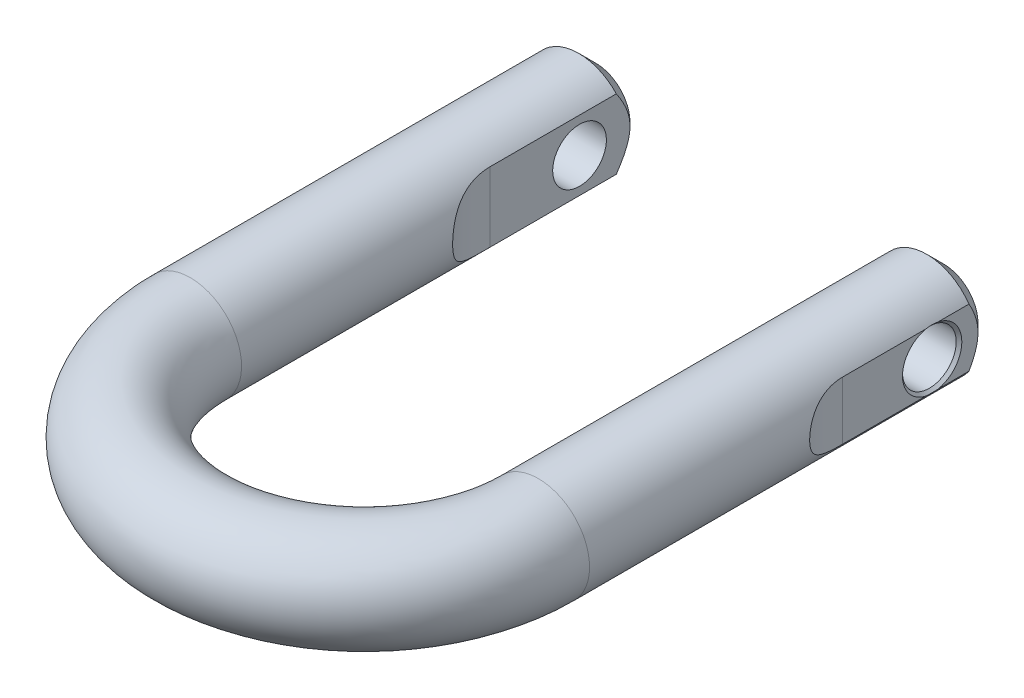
ISO-10303-21;
HEADER;
FILE_DESCRIPTION(('STEP AP214'),'2;1');
FILE_NAME('part.step','',(''),(''),'','','');
FILE_SCHEMA(('AUTOMOTIVE_DESIGN { 1 0 10303 214 1 1 1 1 }'));
ENDSEC;
DATA;
#1=APPLICATION_CONTEXT('core data for automotive mechanical design processes');
#2=APPLICATION_PROTOCOL_DEFINITION('international standard','automotive_design',2000,#1);
#3=PRODUCT_CONTEXT('',#1,'mechanical');
#4=PRODUCT('Part','Part','',(#3));
#5=PRODUCT_RELATED_PRODUCT_CATEGORY('part','',(#4));
#6=PRODUCT_DEFINITION_FORMATION('','',#4);
#7=PRODUCT_DEFINITION_CONTEXT('part definition',#1,'design');
#8=PRODUCT_DEFINITION('design','',#6,#7);
#9=PRODUCT_DEFINITION_SHAPE('','',#8);
#10=(LENGTH_UNIT() NAMED_UNIT(*) SI_UNIT(.MILLI.,.METRE.));
#11=(NAMED_UNIT(*) PLANE_ANGLE_UNIT() SI_UNIT($,.RADIAN.));
#12=(NAMED_UNIT(*) SI_UNIT($,.STERADIAN.) SOLID_ANGLE_UNIT());
#13=UNCERTAINTY_MEASURE_WITH_UNIT(LENGTH_MEASURE(1.E-05),#10,'distance_accuracy_value','');
#14=(GEOMETRIC_REPRESENTATION_CONTEXT(3) GLOBAL_UNCERTAINTY_ASSIGNED_CONTEXT((#13)) GLOBAL_UNIT_ASSIGNED_CONTEXT((#10,
#11,#12)) REPRESENTATION_CONTEXT('',''));
#15=CARTESIAN_POINT('',(0.,0.,0.));
#16=DIRECTION('',(0.,0.,1.));
#17=DIRECTION('',(1.,0.,0.));
#18=AXIS2_PLACEMENT_3D('',#15,#16,#17);
#19=CARTESIAN_POINT('',(40.2336000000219,0.,0.));
#20=DIRECTION('',(1.,0.,0.));
#21=DIRECTION('',(0.,1.,0.));
#22=AXIS2_PLACEMENT_3D('',#19,#20,#21);
#23=CONICAL_SURFACE('',#22,5.52450000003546,0.785398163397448);
#24=CARTESIAN_POINT('',(39.7090999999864,0.,0.));
#25=DIRECTION('',(1.,0.,0.));
#26=DIRECTION('',(0.,1.,0.));
#27=AXIS2_PLACEMENT_3D('',#24,#25,#26);
#28=CIRCLE('',#27,5.);
#29=CARTESIAN_POINT('',(39.7090999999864,5.,0.));
#30=VERTEX_POINT('',#29);
#31=EDGE_CURVE('E346',#30,#30,#28,.F.);
#32=ORIENTED_EDGE('',*,*,#31,.T.);
#33=EDGE_LOOP('',(#32));
#34=FACE_BOUND('',#33,.T.);
#35=CARTESIAN_POINT('',(40.2335999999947,5.41519124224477,1.09352826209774));
#36=CARTESIAN_POINT('',(40.2187093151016,5.43669163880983,0.912058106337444));
#37=CARTESIAN_POINT('',(40.2074641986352,5.45282066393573,0.72964706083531));
#38=CARTESIAN_POINT('',(40.1924772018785,5.47424602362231,0.364820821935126));
#39=CARTESIAN_POINT('',(40.1886972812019,5.47959728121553,0.182410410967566));
#40=CARTESIAN_POINT('',(40.1886972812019,5.47959728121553,-0.182410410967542));
#41=CARTESIAN_POINT('',(40.1924772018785,5.47424602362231,-0.36482082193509));
#42=CARTESIAN_POINT('',(40.2074641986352,5.45282066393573,-0.729647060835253));
#43=CARTESIAN_POINT('',(40.2187093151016,5.43669163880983,-0.912058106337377));
#44=CARTESIAN_POINT('',(40.2335999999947,5.41519124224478,-1.09352826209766));
#45=B_SPLINE_CURVE_WITH_KNOTS('',3,(#35,#36,#37,#38,#39,#40,#41,#42,#43,#44),.UNSPECIFIED.,.F.,
.F.,(4,2,2,2,4),(0.,0.549927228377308,1.09704488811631,1.64416254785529,2.19408977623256),.UNSPECIFIED.);
#46=CARTESIAN_POINT('',(40.2336000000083,5.4151912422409,1.0935282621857));
#47=VERTEX_POINT('',#46);
#48=CARTESIAN_POINT('',(40.2336000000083,5.4151912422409,-1.09352826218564));
#49=VERTEX_POINT('',#48);
#50=EDGE_CURVE('E65',#47,#49,#45,.T.);
#51=ORIENTED_EDGE('',*,*,#50,.F.);
#52=CARTESIAN_POINT('',(40.2336000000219,0.,0.));
#53=DIRECTION('',(1.,0.,0.));
#54=DIRECTION('',(0.,1.,0.));
#55=AXIS2_PLACEMENT_3D('',#52,#53,#54);
#56=CIRCLE('',#55,5.52450000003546);
#57=CARTESIAN_POINT('',(40.2336000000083,-5.4151912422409,1.09352826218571));
#58=VERTEX_POINT('',#57);
#59=EDGE_CURVE('E536',#47,#58,#56,.T.);
#60=ORIENTED_EDGE('',*,*,#59,.T.);
#61=CARTESIAN_POINT('',(40.2335999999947,-5.41519124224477,-1.09352826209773));
#62=CARTESIAN_POINT('',(40.2187093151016,-5.43669163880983,-0.91205810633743));
#63=CARTESIAN_POINT('',(40.2074641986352,-5.45282066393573,-0.729647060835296));
#64=CARTESIAN_POINT('',(40.1924772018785,-5.47424602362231,-0.364820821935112));
#65=CARTESIAN_POINT('',(40.1886972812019,-5.47959728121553,-0.182410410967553));
#66=CARTESIAN_POINT('',(40.1886972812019,-5.47959728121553,0.182410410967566));
#67=CARTESIAN_POINT('',(40.1924772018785,-5.47424602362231,0.364820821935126));
#68=CARTESIAN_POINT('',(40.2074641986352,-5.45282066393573,0.72964706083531));
#69=CARTESIAN_POINT('',(40.2187093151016,-5.43669163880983,0.912058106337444));
#70=CARTESIAN_POINT('',(40.2335999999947,-5.41519124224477,1.09352826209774));
#71=B_SPLINE_CURVE_WITH_KNOTS('',3,(#61,#62,#63,#64,#65,#66,#67,#68,#69,#70),.UNSPECIFIED.,.F.,
.F.,(4,2,2,2,4),(0.,0.549927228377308,1.09704488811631,1.64416254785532,2.19408977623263),.UNSPECIFIED.);
#72=CARTESIAN_POINT('',(40.2336000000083,-5.41519124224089,-1.09352826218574));
#73=VERTEX_POINT('',#72);
#74=EDGE_CURVE('E234',#73,#58,#71,.T.);
#75=ORIENTED_EDGE('',*,*,#74,.F.);
#76=CARTESIAN_POINT('',(40.2336000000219,0.,0.));
#77=DIRECTION('',(1.,0.,0.));
#78=DIRECTION('',(0.,1.,0.));
#79=AXIS2_PLACEMENT_3D('',#76,#77,#78);
#80=CIRCLE('',#79,5.52450000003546);
#81=EDGE_CURVE('E130',#73,#49,#80,.T.);
#82=ORIENTED_EDGE('',*,*,#81,.T.);
#83=EDGE_LOOP('',(#51,#60,#75,#82));
#84=FACE_BOUND('',#83,.T.);
#85=ADVANCED_FACE('F14',(#34,#84),#23,.F.);
#86=CARTESIAN_POINT('',(32.3977,0.,-10.0203));
#87=DIRECTION('',(0.,0.,1.));
#88=DIRECTION('',(0.,-1.,0.));
#89=AXIS2_PLACEMENT_3D('',#86,#87,#88);
#90=PLANE('',#89);
#91=CARTESIAN_POINT('',(32.3977,0.,-10.0203));
#92=DIRECTION('',(0.,0.,1.));
#93=DIRECTION('',(0.,-1.,0.));
#94=AXIS2_PLACEMENT_3D('',#91,#92,#93);
#95=CIRCLE('',#94,6.35);
#96=CARTESIAN_POINT('',(32.3977,-6.35,-10.0203));
#97=VERTEX_POINT('',#96);
#98=EDGE_CURVE('E129',#97,#97,#95,.T.);
#99=ORIENTED_EDGE('',*,*,#98,.F.);
#100=EDGE_LOOP('',(#99));
#101=FACE_BOUND('',#100,.T.);
#102=ADVANCED_FACE('F250',(#101),#90,.F.);
#103=CARTESIAN_POINT('',(-32.3977,0.,-10.0203));
#104=DIRECTION('',(0.,0.,-1.));
#105=DIRECTION('',(1.,0.,0.));
#106=AXIS2_PLACEMENT_3D('',#103,#104,#105);
#107=PLANE('',#106);
#108=CARTESIAN_POINT('',(-32.3977,0.,-10.0202999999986));
#109=DIRECTION('',(0.,0.,1.));
#110=DIRECTION('',(0.,-1.,0.));
#111=AXIS2_PLACEMENT_3D('',#108,#109,#110);
#112=CIRCLE('',#111,6.34999999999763);
#113=CARTESIAN_POINT('',(-32.3977,-6.34999999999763,-10.0202999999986));
#114=VERTEX_POINT('',#113);
#115=EDGE_CURVE('E299',#114,#114,#112,.T.);
#116=ORIENTED_EDGE('',*,*,#115,.F.);
#117=EDGE_LOOP('',(#116));
#118=FACE_BOUND('',#117,.T.);
#119=ADVANCED_FACE('F245',(#118),#107,.T.);
#120=CARTESIAN_POINT('',(-40.2336000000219,0.,0.));
#121=DIRECTION('',(-1.,0.,0.));
#122=DIRECTION('',(0.,-1.,0.));
#123=AXIS2_PLACEMENT_3D('',#120,#121,#122);
#124=CONICAL_SURFACE('',#123,5.52450000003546,0.785398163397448);
#125=CARTESIAN_POINT('',(-39.7090999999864,0.,0.));
#126=DIRECTION('',(-1.,0.,0.));
#127=DIRECTION('',(0.,-1.,0.));
#128=AXIS2_PLACEMENT_3D('',#125,#126,#127);
#129=CIRCLE('',#128,5.);
#130=CARTESIAN_POINT('',(-39.7090999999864,-5.,0.));
#131=VERTEX_POINT('',#130);
#132=EDGE_CURVE('E349',#131,#131,#129,.F.);
#133=ORIENTED_EDGE('',*,*,#132,.T.);
#134=EDGE_LOOP('',(#133));
#135=FACE_BOUND('',#134,.T.);
#136=CARTESIAN_POINT('',(-40.2335999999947,-5.41519124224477,1.09352826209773));
#137=CARTESIAN_POINT('',(-40.2187093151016,-5.43669163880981,0.91205810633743));
#138=CARTESIAN_POINT('',(-40.2074641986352,-5.45282066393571,0.729647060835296));
#139=CARTESIAN_POINT('',(-40.1924772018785,-5.4742460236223,0.364820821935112));
#140=CARTESIAN_POINT('',(-40.1886972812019,-5.47959728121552,0.182410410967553));
#141=CARTESIAN_POINT('',(-40.1886972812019,-5.47959728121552,-0.182410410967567));
#142=CARTESIAN_POINT('',(-40.1924772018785,-5.4742460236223,-0.364820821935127));
#143=CARTESIAN_POINT('',(-40.2074641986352,-5.45282066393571,-0.729647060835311));
#144=CARTESIAN_POINT('',(-40.2187093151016,-5.43669163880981,-0.912058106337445));
#145=CARTESIAN_POINT('',(-40.2335999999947,-5.41519124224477,-1.09352826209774));
#146=B_SPLINE_CURVE_WITH_KNOTS('',3,(#136,#137,#138,#139,#140,#141,#142,#143,#144,#145),
.UNSPECIFIED.,.F.,.F.,(4,2,2,2,4),(0.,0.549927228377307,1.09704488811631,1.64416254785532,
2.19408977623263),.UNSPECIFIED.);
#147=CARTESIAN_POINT('',(-40.2336000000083,-5.4151912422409,1.09352826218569));
#148=VERTEX_POINT('',#147);
#149=CARTESIAN_POINT('',(-40.2336000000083,-5.4151912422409,-1.0935282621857));
#150=VERTEX_POINT('',#149);
#151=EDGE_CURVE('E228',#148,#150,#146,.T.);
#152=ORIENTED_EDGE('',*,*,#151,.F.);
#153=CARTESIAN_POINT('',(-40.2336000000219,0.,0.));
#154=DIRECTION('',(-1.,0.,0.));
#155=DIRECTION('',(0.,-1.,0.));
#156=AXIS2_PLACEMENT_3D('',#153,#154,#155);
#157=CIRCLE('',#156,5.52450000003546);
#158=CARTESIAN_POINT('',(-40.2336000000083,5.4151912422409,1.09352826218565));
#159=VERTEX_POINT('',#158);
#160=EDGE_CURVE('E169',#148,#159,#157,.T.);
#161=ORIENTED_EDGE('',*,*,#160,.T.);
#162=CARTESIAN_POINT('',(-40.2335999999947,5.41519124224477,-1.09352826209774));
#163=CARTESIAN_POINT('',(-40.2187093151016,5.43669163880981,-0.912058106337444));
#164=CARTESIAN_POINT('',(-40.2074641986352,5.45282066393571,-0.729647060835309));
#165=CARTESIAN_POINT('',(-40.1924772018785,5.4742460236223,-0.364820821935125));
#166=CARTESIAN_POINT('',(-40.1886972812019,5.47959728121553,-0.182410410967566));
#167=CARTESIAN_POINT('',(-40.1886972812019,5.47959728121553,0.182410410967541));
#168=CARTESIAN_POINT('',(-40.1924772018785,5.4742460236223,0.364820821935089));
#169=CARTESIAN_POINT('',(-40.2074641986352,5.45282066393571,0.72964706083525));
#170=CARTESIAN_POINT('',(-40.2187093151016,5.43669163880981,0.912058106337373));
#171=CARTESIAN_POINT('',(-40.2335999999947,5.41519124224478,1.09352826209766));
#172=B_SPLINE_CURVE_WITH_KNOTS('',3,(#162,#163,#164,#165,#166,#167,#168,#169,#170,#171),
.UNSPECIFIED.,.F.,.F.,(4,2,2,2,4),(0.,0.549927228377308,1.09704488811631,1.64416254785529,
2.19408977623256),.UNSPECIFIED.);
#173=CARTESIAN_POINT('',(-40.2336000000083,5.41519124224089,-1.09352826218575));
#174=VERTEX_POINT('',#173);
#175=EDGE_CURVE('E33',#174,#159,#172,.T.);
#176=ORIENTED_EDGE('',*,*,#175,.F.);
#177=CARTESIAN_POINT('',(-40.2336000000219,0.,0.));
#178=DIRECTION('',(-1.,0.,0.));
#179=DIRECTION('',(0.,-1.,0.));
#180=AXIS2_PLACEMENT_3D('',#177,#178,#179);
#181=CIRCLE('',#180,5.52450000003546);
#182=EDGE_CURVE('E184',#174,#150,#181,.T.);
#183=ORIENTED_EDGE('',*,*,#182,.T.);
#184=EDGE_LOOP('',(#152,#161,#176,#183));
#185=FACE_BOUND('',#184,.T.);
#186=ADVANCED_FACE('F239',(#135,#185),#124,.F.);
#187=CARTESIAN_POINT('',(40.2336,12.7,-47.3384957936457));
#188=DIRECTION('',(-1.,0.,0.));
#189=DIRECTION('',(0.,-1.,0.));
#190=AXIS2_PLACEMENT_3D('',#187,#188,#189);
#191=PLANE('',#190);
#192=DIRECTION('',(0.,0.,-1.));
#193=VECTOR('',#192,1.);
#194=CARTESIAN_POINT('',(40.2336,5.41519124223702,65.4812));
#195=LINE('',#194,#193);
#196=CARTESIAN_POINT('',(40.2336,5.41519124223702,16.6497));
#197=VERTEX_POINT('',#196);
#198=EDGE_CURVE('E73',#197,#47,#195,.T.);
#199=ORIENTED_EDGE('',*,*,#198,.F.);
#200=DIRECTION('',(0.,-1.,0.));
#201=VECTOR('',#200,1.);
#202=CARTESIAN_POINT('',(40.2336,12.7,16.6497));
#203=LINE('',#202,#201);
#204=CARTESIAN_POINT('',(40.2336,-5.41519124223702,16.6497));
#205=VERTEX_POINT('',#204);
#206=EDGE_CURVE('E172',#197,#205,#203,.T.);
#207=ORIENTED_EDGE('',*,*,#206,.T.);
#208=DIRECTION('',(0.,0.,-1.));
#209=VECTOR('',#208,1.);
#210=CARTESIAN_POINT('',(40.2336,-5.41519124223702,65.4812));
#211=LINE('',#210,#209);
#212=EDGE_CURVE('E136',#58,#205,#211,.F.);
#213=ORIENTED_EDGE('',*,*,#212,.F.);
#214=ORIENTED_EDGE('',*,*,#59,.F.);
#215=EDGE_LOOP('',(#199,#207,#213,#214));
#216=FACE_BOUND('',#215,.T.);
#217=ADVANCED_FACE('F244',(#216),#191,.F.);
#218=CARTESIAN_POINT('',(40.2336,12.7,-47.3384957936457));
#219=DIRECTION('',(-1.,0.,0.));
#220=DIRECTION('',(0.,-1.,0.));
#221=AXIS2_PLACEMENT_3D('',#218,#219,#220);
#222=PLANE('',#221);
#223=DIRECTION('',(0.,0.,-1.));
#224=VECTOR('',#223,1.);
#225=CARTESIAN_POINT('',(40.2336,-5.415191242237,65.4812));
#226=LINE('',#225,#224);
#227=CARTESIAN_POINT('',(40.2336,-5.41519124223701,-6.8453));
#228=VERTEX_POINT('',#227);
#229=EDGE_CURVE('E127',#228,#73,#226,.F.);
#230=ORIENTED_EDGE('',*,*,#229,.F.);
#231=CARTESIAN_POINT('',(40.2336,5.41519124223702,-6.8453));
#232=CARTESIAN_POINT('',(40.2336,5.27410364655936,-6.92550063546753));
#233=CARTESIAN_POINT('',(40.2336,5.13210356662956,-7.00412014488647));
#234=CARTESIAN_POINT('',(40.2336,4.84610549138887,-7.15772932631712));
#235=CARTESIAN_POINT('',(40.2336,4.70210695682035,-7.23271799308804));
#236=CARTESIAN_POINT('',(40.2336,4.41143066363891,-7.37884775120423));
#237=CARTESIAN_POINT('',(40.2336,4.26474443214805,-7.44997207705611));
#238=CARTESIAN_POINT('',(40.2336,3.96917047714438,-7.58744544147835));
#239=CARTESIAN_POINT('',(40.2336,3.82028291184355,-7.65379482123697));
#240=CARTESIAN_POINT('',(40.2336,3.36643873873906,-7.84630562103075));
#241=CARTESIAN_POINT('',(40.2336,3.05784812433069,-7.96411115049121));
#242=CARTESIAN_POINT('',(40.2336,2.4315417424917,-8.17110673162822));
#243=CARTESIAN_POINT('',(40.2336,2.11384136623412,-8.26034226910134));
#244=CARTESIAN_POINT('',(40.2336,1.5624208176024,-8.38329404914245));
#245=CARTESIAN_POINT('',(40.2336,1.33061604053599,-8.42558724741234));
#246=CARTESIAN_POINT('',(40.2336,0.864182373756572,-8.49027088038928));
#247=CARTESIAN_POINT('',(40.2336,0.629553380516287,-8.51266058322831));
#248=CARTESIAN_POINT('',(40.2336,0.160922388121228,-8.53621662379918));
#249=CARTESIAN_POINT('',(40.2336,-0.0730718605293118,-8.53753537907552));
#250=CARTESIAN_POINT('',(40.2336,-0.5402304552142,-8.51926868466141));
#251=CARTESIAN_POINT('',(40.2336,-0.773394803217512,-8.49968328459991));
#252=CARTESIAN_POINT('',(40.2336,-1.23611696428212,-8.44080747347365));
#253=CARTESIAN_POINT('',(40.2336,-1.46568627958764,-8.40160605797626));
#254=CARTESIAN_POINT('',(40.2336,-1.9210440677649,-8.30542734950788));
#255=CARTESIAN_POINT('',(40.2336,-2.14683214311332,-8.24844819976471));
#256=CARTESIAN_POINT('',(40.2336,-2.59522378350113,-8.11862415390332));
#257=CARTESIAN_POINT('',(40.2336,-2.81780001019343,-8.04568584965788));
#258=CARTESIAN_POINT('',(40.2336,-3.2580859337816,-7.88653215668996));
#259=CARTESIAN_POINT('',(40.2336,-3.47579587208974,-7.80031742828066));
#260=CARTESIAN_POINT('',(40.2336,-3.98844206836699,-7.5818663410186));
#261=CARTESIAN_POINT('',(40.2336,-4.28123405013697,-7.44460288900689));
#262=CARTESIAN_POINT('',(40.2336,-4.7126865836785,-7.22723961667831));
#263=CARTESIAN_POINT('',(40.2336,-4.85451216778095,-7.15327896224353));
#264=CARTESIAN_POINT('',(40.2336,-5.13624643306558,-7.00182742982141));
#265=CARTESIAN_POINT('',(40.2336,-5.27615533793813,-6.92433696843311));
#266=CARTESIAN_POINT('',(40.2336,-5.41519124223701,-6.8453));
#267=B_SPLINE_CURVE_WITH_KNOTS('',3,(#231,#232,#233,#234,#235,#236,#237,#238,#239,#240,#241,
#242,#243,#244,#245,#246,#247,#248,#249,#250,#251,#252,#253,#254,#255,#256,#257,#258,#259,#260,
#261,#262,#263,#264,#265,#266),.UNSPECIFIED.,.F.,.F.,(4,2,2,2,2,2,2,2,2,2,2,2,2,2,2,2,2,4),(0.,
0.486874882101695,0.973883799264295,1.46285994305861,1.95180111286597,2.94161755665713,
3.92985020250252,4.63598395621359,5.3421436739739,6.04319302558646,6.7442407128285,
7.4421362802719,8.1401047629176,8.84227323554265,9.54440679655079,10.5137719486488,
10.9935935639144,11.4733586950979),.UNSPECIFIED.);
#268=CARTESIAN_POINT('',(40.2336,5.41519124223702,-6.8453));
#269=VERTEX_POINT('',#268);
#270=EDGE_CURVE('E111',#269,#228,#267,.T.);
#271=ORIENTED_EDGE('',*,*,#270,.F.);
#272=DIRECTION('',(0.,0.,-1.));
#273=VECTOR('',#272,1.);
#274=CARTESIAN_POINT('',(40.2336,5.41519124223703,65.4812));
#275=LINE('',#274,#273);
#276=EDGE_CURVE('E120',#49,#269,#275,.T.);
#277=ORIENTED_EDGE('',*,*,#276,.F.);
#278=ORIENTED_EDGE('',*,*,#81,.F.);
#279=EDGE_LOOP('',(#230,#271,#277,#278));
#280=FACE_BOUND('',#279,.T.);
#281=ADVANCED_FACE('F124',(#280),#222,.F.);
#282=CARTESIAN_POINT('',(32.3977,0.,-6.8453));
#283=DIRECTION('',(0.,0.,1.));
#284=DIRECTION('',(0.,-1.,0.));
#285=AXIS2_PLACEMENT_3D('',#282,#283,#284);
#286=CONICAL_SURFACE('',#285,9.525,0.785398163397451);
#287=ORIENTED_EDGE('',*,*,#98,.T.);
#288=EDGE_LOOP('',(#287));
#289=FACE_BOUND('',#288,.T.);
#290=CARTESIAN_POINT('',(25.4254,-6.48942660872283,-6.8453));
#291=CARTESIAN_POINT('',(25.4254,-6.3299579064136,-6.95392500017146));
#292=CARTESIAN_POINT('',(25.4254,-6.16949937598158,-7.06112077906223));
#293=CARTESIAN_POINT('',(25.4254,-5.84629987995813,-7.27210839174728));
#294=CARTESIAN_POINT('',(25.4254,-5.68355830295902,-7.37589928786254));
#295=CARTESIAN_POINT('',(25.4254,-5.35457370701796,-7.58009424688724));
#296=CARTESIAN_POINT('',(25.4254,-5.18831535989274,-7.68047371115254));
#297=CARTESIAN_POINT('',(25.4254,-4.85299655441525,-7.87641847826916));
#298=CARTESIAN_POINT('',(25.4254,-4.68393629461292,-7.97198412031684));
#299=CARTESIAN_POINT('',(25.4254,-4.33700838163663,-8.16050673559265));
#300=CARTESIAN_POINT('',(25.4254,-4.159034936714,-8.25327077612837));
#301=CARTESIAN_POINT('',(25.4254,-3.79947441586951,-8.43149725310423));
#302=CARTESIAN_POINT('',(25.4254,-3.61788690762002,-8.5169588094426));
#303=CARTESIAN_POINT('',(25.4254,-3.06810644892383,-8.75989307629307));
#304=CARTESIAN_POINT('',(25.4254,-2.69389598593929,-8.9044758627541));
#305=CARTESIAN_POINT('',(25.4254,-2.10173718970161,-9.0908427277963));
#306=CARTESIAN_POINT('',(25.4254,-1.88910977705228,-9.1496291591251));
#307=CARTESIAN_POINT('',(25.4254,-1.45972003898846,-9.24989241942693));
#308=CARTESIAN_POINT('',(25.4254,-1.24295752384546,-9.2913684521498));
#309=CARTESIAN_POINT('',(25.4254,-0.809413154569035,-9.35440676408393));
#310=CARTESIAN_POINT('',(25.4254,-0.592668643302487,-9.37622243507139));
#311=CARTESIAN_POINT('',(25.4254,-0.158086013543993,-9.39958248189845));
#312=CARTESIAN_POINT('',(25.4254,0.0597520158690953,-9.40112848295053));
#313=CARTESIAN_POINT('',(25.4254,0.494780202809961,-9.38384988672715));
#314=CARTESIAN_POINT('',(25.4254,0.711969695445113,-9.36500884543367));
#315=CARTESIAN_POINT('',(25.4254,1.14378943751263,-9.30805010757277));
#316=CARTESIAN_POINT('',(25.4254,1.35841936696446,-9.26993002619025));
#317=CARTESIAN_POINT('',(25.4254,1.78658388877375,-9.17581403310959));
#318=CARTESIAN_POINT('',(25.4254,2.00006835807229,-9.11959316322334));
#319=CARTESIAN_POINT('',(25.4254,2.42236617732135,-8.99193316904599));
#320=CARTESIAN_POINT('',(25.4254,2.63117957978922,-8.92049421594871));
#321=CARTESIAN_POINT('',(25.4254,3.16806360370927,-8.71812632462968));
#322=CARTESIAN_POINT('',(25.4254,3.49237235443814,-8.57725009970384));
#323=CARTESIAN_POINT('',(25.4254,4.12977822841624,-8.27155804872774));
#324=CARTESIAN_POINT('',(25.4254,4.44285934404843,-8.10670961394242));
#325=CARTESIAN_POINT('',(25.4254,4.90019882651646,-7.84916083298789));
#326=CARTESIAN_POINT('',(25.4254,5.04825661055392,-7.76309435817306));
#327=CARTESIAN_POINT('',(25.4254,5.34227141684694,-7.58742393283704));
#328=CARTESIAN_POINT('',(25.4254,5.48822834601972,-7.497819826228));
#329=CARTESIAN_POINT('',(25.4254,5.77772532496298,-7.31588470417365));
#330=CARTESIAN_POINT('',(25.4254,5.92127196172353,-7.22356412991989));
#331=CARTESIAN_POINT('',(25.4254,6.20661280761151,-7.03630379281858));
#332=CARTESIAN_POINT('',(25.4254,6.34840731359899,-6.94136448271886));
#333=CARTESIAN_POINT('',(25.4254,6.48942660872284,-6.8453));
#334=B_SPLINE_CURVE_WITH_KNOTS('',3,(#290,#291,#292,#293,#294,#295,#296,#297,#298,#299,#300,
#301,#302,#303,#304,#305,#306,#307,#308,#309,#310,#311,#312,#313,#314,#315,#316,#317,#318,#319,
#320,#321,#322,#323,#324,#325,#326,#327,#328,#329,#330,#331,#332,#333),.UNSPECIFIED.,.F.,.F.,(4,
2,2,2,2,2,2,2,2,2,2,2,2,2,2,2,2,2,2,2,2,4),(0.,0.578861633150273,1.1578813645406,
1.74044268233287,2.32296289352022,2.92488701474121,3.52688357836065,4.72744866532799,
5.38868360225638,6.04994895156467,6.70256439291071,7.3551275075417,8.00821736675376,
8.66138803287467,9.32301180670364,9.9846281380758,11.0439353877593,12.1046973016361,
12.6184267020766,13.1321787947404,13.6441635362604,14.156060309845),.UNSPECIFIED.);
#335=CARTESIAN_POINT('',(25.4254,-6.48942660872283,-6.8453));
#336=VERTEX_POINT('',#335);
#337=CARTESIAN_POINT('',(25.4254,6.48942660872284,-6.8453));
#338=VERTEX_POINT('',#337);
#339=EDGE_CURVE('E114',#336,#338,#334,.T.);
#340=ORIENTED_EDGE('',*,*,#339,.T.);
#341=CARTESIAN_POINT('',(32.3977,0.,-6.8453));
#342=DIRECTION('',(0.,0.,-1.));
#343=DIRECTION('',(1.,0.,0.));
#344=AXIS2_PLACEMENT_3D('',#341,#342,#343);
#345=CIRCLE('',#344,9.525);
#346=EDGE_CURVE('E108',#269,#338,#345,.F.);
#347=ORIENTED_EDGE('',*,*,#346,.F.);
#348=ORIENTED_EDGE('',*,*,#270,.T.);
#349=CARTESIAN_POINT('',(32.3977,0.,-6.8453));
#350=DIRECTION('',(0.,0.,-1.));
#351=DIRECTION('',(1.,0.,0.));
#352=AXIS2_PLACEMENT_3D('',#349,#350,#351);
#353=CIRCLE('',#352,9.525);
#354=EDGE_CURVE('E144',#336,#228,#353,.F.);
#355=ORIENTED_EDGE('',*,*,#354,.F.);
#356=EDGE_LOOP('',(#340,#347,#348,#355));
#357=FACE_BOUND('',#356,.T.);
#358=ADVANCED_FACE('F110',(#289,#357),#286,.T.);
#359=CARTESIAN_POINT('',(25.4254,12.7,-17.2148171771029));
#360=DIRECTION('',(1.,0.,0.));
#361=DIRECTION('',(0.,1.,0.));
#362=AXIS2_PLACEMENT_3D('',#359,#360,#361);
#363=PLANE('',#362);
#364=CARTESIAN_POINT('',(25.4254,0.,0.));
#365=DIRECTION('',(1.,0.,0.));
#366=DIRECTION('',(0.,1.,0.));
#367=AXIS2_PLACEMENT_3D('',#364,#365,#366);
#368=CIRCLE('',#367,5.);
#369=CARTESIAN_POINT('',(25.4254,5.,0.));
#370=VERTEX_POINT('',#369);
#371=EDGE_CURVE('E352',#370,#370,#368,.T.);
#372=ORIENTED_EDGE('',*,*,#371,.T.);
#373=EDGE_LOOP('',(#372));
#374=FACE_BOUND('',#373,.T.);
#375=DIRECTION('',(0.,0.,-1.));
#376=VECTOR('',#375,1.);
#377=CARTESIAN_POINT('',(25.4254,-6.48942660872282,65.4812));
#378=LINE('',#377,#376);
#379=CARTESIAN_POINT('',(25.4254,-6.48942660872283,16.6497));
#380=VERTEX_POINT('',#379);
#381=EDGE_CURVE('E170',#380,#336,#378,.T.);
#382=ORIENTED_EDGE('',*,*,#381,.F.);
#383=DIRECTION('',(0.,-1.,0.));
#384=VECTOR('',#383,1.);
#385=CARTESIAN_POINT('',(25.4254,12.7,16.6497));
#386=LINE('',#385,#384);
#387=CARTESIAN_POINT('',(25.4254,6.48942660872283,16.6497));
#388=VERTEX_POINT('',#387);
#389=EDGE_CURVE('E174',#380,#388,#386,.F.);
#390=ORIENTED_EDGE('',*,*,#389,.T.);
#391=DIRECTION('',(0.,0.,-1.));
#392=VECTOR('',#391,1.);
#393=CARTESIAN_POINT('',(25.4254,6.48942660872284,65.4812));
#394=LINE('',#393,#392);
#395=EDGE_CURVE('E119',#338,#388,#394,.F.);
#396=ORIENTED_EDGE('',*,*,#395,.F.);
#397=ORIENTED_EDGE('',*,*,#339,.F.);
#398=EDGE_LOOP('',(#382,#390,#396,#397));
#399=FACE_BOUND('',#398,.T.);
#400=ADVANCED_FACE('F356',(#374,#399),#363,.F.);
#401=CARTESIAN_POINT('',(6.3754,12.7,16.6497));
#402=DIRECTION('',(0.,-1.,0.));
#403=DIRECTION('',(1.,0.,0.));
#404=AXIS2_PLACEMENT_3D('',#401,#402,#403);
#405=CYLINDRICAL_SURFACE('',#404,19.05);
#406=ORIENTED_EDGE('',*,*,#389,.F.);
#407=CARTESIAN_POINT('',(25.4254,6.48942660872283,16.6497));
#408=CARTESIAN_POINT('',(25.4254031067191,6.48941915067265,16.8191491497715));
#409=CARTESIAN_POINT('',(25.4231391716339,6.48699726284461,16.9885981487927));
#410=CARTESIAN_POINT('',(25.4140999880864,6.47727078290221,17.3272427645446));
#411=CARTESIAN_POINT('',(25.4073245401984,6.46996597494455,17.4964383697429));
#412=CARTESIAN_POINT('',(25.3892753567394,6.45040923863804,17.8344906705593));
#413=CARTESIAN_POINT('',(25.3779967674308,6.43815197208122,18.0033468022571));
#414=CARTESIAN_POINT('',(25.3509928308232,6.40858295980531,18.340246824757));
#415=CARTESIAN_POINT('',(25.3352675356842,6.39127127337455,18.5082907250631));
#416=CARTESIAN_POINT('',(25.2811865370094,6.33118214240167,19.0138506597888));
#417=CARTESIAN_POINT('',(25.2360883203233,6.28041976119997,19.3497645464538));
#418=CARTESIAN_POINT('',(25.1289138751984,6.15606363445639,20.0144349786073));
#419=CARTESIAN_POINT('',(25.0668465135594,6.08248180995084,20.3431951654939));
#420=CARTESIAN_POINT('',(24.9446248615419,5.93162471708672,20.9097679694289));
#421=CARTESIAN_POINT('',(24.8878642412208,5.85986156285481,21.149788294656));
#422=CARTESIAN_POINT('',(24.7664754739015,5.70088207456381,21.6226659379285));
#423=CARTESIAN_POINT('',(24.7018472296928,5.61366554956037,21.8555231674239));
#424=CARTESIAN_POINT('',(24.5661410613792,5.42272814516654,22.3114874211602));
#425=CARTESIAN_POINT('',(24.4950851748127,5.31906280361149,22.5346241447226));
#426=CARTESIAN_POINT('',(24.347921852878,5.0936053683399,22.9697990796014));
#427=CARTESIAN_POINT('',(24.2718160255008,4.97181902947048,23.1818407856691));
#428=CARTESIAN_POINT('',(24.1369128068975,4.74317552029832,23.538638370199));
#429=CARTESIAN_POINT('',(24.0787925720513,4.64074028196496,23.6864914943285));
#430=CARTESIAN_POINT('',(23.9619532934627,4.42480243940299,23.9736090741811));
#431=CARTESIAN_POINT('',(23.9032344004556,4.31130256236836,24.1128756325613));
#432=CARTESIAN_POINT('',(23.7864121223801,4.07295041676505,24.3814907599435));
#433=CARTESIAN_POINT('',(23.7283083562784,3.94810569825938,24.5108458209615));
#434=CARTESIAN_POINT('',(23.6140719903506,3.68698467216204,24.758293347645));
#435=CARTESIAN_POINT('',(23.5579390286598,3.55071047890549,24.8763878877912));
#436=CARTESIAN_POINT('',(23.414919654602,3.17747214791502,25.1701518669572));
#437=CARTESIAN_POINT('',(23.3308259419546,2.93096224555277,25.3354769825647));
#438=CARTESIAN_POINT('',(23.2169020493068,2.54106543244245,25.5532440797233));
#439=CARTESIAN_POINT('',(23.1809506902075,2.40768274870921,25.6208189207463));
#440=CARTESIAN_POINT('',(23.1139595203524,2.13482510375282,25.7451986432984));
#441=CARTESIAN_POINT('',(23.0829173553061,1.99535310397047,25.8020086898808));
#442=CARTESIAN_POINT('',(23.0256456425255,1.70662532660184,25.9058038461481));
#443=CARTESIAN_POINT('',(22.9996007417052,1.55719943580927,25.9524186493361));
#444=CARTESIAN_POINT('',(22.9543513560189,1.25391083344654,26.0328233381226));
#445=CARTESIAN_POINT('',(22.9351469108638,1.10004809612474,26.0666131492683));
#446=CARTESIAN_POINT('',(22.9041732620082,0.789273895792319,26.1208739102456));
#447=CARTESIAN_POINT('',(22.89240281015,0.632362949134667,26.1413470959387));
#448=CARTESIAN_POINT('',(22.8766662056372,0.316968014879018,26.1686791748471));
#449=CARTESIAN_POINT('',(22.8726999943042,0.158484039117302,26.1755381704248));
#450=CARTESIAN_POINT('',(22.8727000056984,-0.158558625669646,26.1755381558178));
#451=CARTESIAN_POINT('',(22.8766699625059,-0.317117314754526,26.1686726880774));
#452=CARTESIAN_POINT('',(22.8924212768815,-0.632658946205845,26.1413149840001));
#453=CARTESIAN_POINT('',(22.9042026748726,-0.78964188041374,26.1208226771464));
#454=CARTESIAN_POINT('',(22.9352053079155,-1.1005609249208,26.0665105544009));
#455=CARTESIAN_POINT('',(22.9544280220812,-1.2544964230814,26.0326880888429));
#456=CARTESIAN_POINT('',(22.9997198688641,-1.55792583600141,25.9522059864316));
#457=CARTESIAN_POINT('',(23.0257890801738,-1.70741969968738,25.9055462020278));
#458=CARTESIAN_POINT('',(23.0838309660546,-1.99988774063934,25.8003506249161));
#459=CARTESIAN_POINT('',(23.1157658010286,-2.14289677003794,25.7418907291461));
#460=CARTESIAN_POINT('',(23.1847762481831,-2.42248705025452,25.6136663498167));
#461=CARTESIAN_POINT('',(23.2218545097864,-2.55906493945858,25.5438960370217));
#462=CARTESIAN_POINT('',(23.3394100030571,-2.95798108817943,25.3188031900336));
#463=CARTESIAN_POINT('',(23.4262573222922,-3.20973856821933,25.1476120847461));
#464=CARTESIAN_POINT('',(23.5743427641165,-3.59148121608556,24.8421266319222));
#465=CARTESIAN_POINT('',(23.6327938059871,-3.73142424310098,24.7184803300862));
#466=CARTESIAN_POINT('',(23.7516229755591,-3.99904555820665,24.4592882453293));
#467=CARTESIAN_POINT('',(23.8120015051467,-4.12672126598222,24.3237399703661));
#468=CARTESIAN_POINT('',(23.9332094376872,-4.36995768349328,24.0422191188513));
#469=CARTESIAN_POINT('',(23.994039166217,-4.48550849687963,23.8962381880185));
#470=CARTESIAN_POINT('',(24.1148288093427,-4.70482060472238,23.5953085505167));
#471=CARTESIAN_POINT('',(24.1747884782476,-4.80857862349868,23.4403573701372));
#472=CARTESIAN_POINT('',(24.3142336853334,-5.04059925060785,23.0648461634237));
#473=CARTESIAN_POINT('',(24.3928687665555,-5.16400554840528,22.8409612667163));
#474=CARTESIAN_POINT('',(24.5442221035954,-5.39139740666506,22.3816242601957));
#475=CARTESIAN_POINT('',(24.6169382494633,-5.49537605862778,22.1461680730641));
#476=CARTESIAN_POINT('',(24.7549729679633,-5.68579087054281,21.6653303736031));
#477=CARTESIAN_POINT('',(24.8202686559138,-5.77217338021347,21.4199211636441));
#478=CARTESIAN_POINT('',(24.9419735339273,-5.92853883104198,20.9217765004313));
#479=CARTESIAN_POINT('',(24.998380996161,-5.9985185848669,20.6690396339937));
#480=CARTESIAN_POINT('',(25.1113421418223,-6.13546885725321,20.108553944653));
#481=CARTESIAN_POINT('',(25.1658211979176,-6.19924952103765,19.7996054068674));
#482=CARTESIAN_POINT('',(25.2597799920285,-6.30720410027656,19.1760041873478));
#483=CARTESIAN_POINT('',(25.2992548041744,-6.35137157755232,18.8613496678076));
#484=CARTESIAN_POINT('',(25.3622549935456,-6.42108503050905,18.2312140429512));
#485=CARTESIAN_POINT('',(25.3859175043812,-6.44679126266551,17.9157645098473));
#486=CARTESIAN_POINT('',(25.4095964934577,-6.4724143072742,17.441490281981));
#487=CARTESIAN_POINT('',(25.4155203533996,-6.47879929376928,17.2832622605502));
#488=CARTESIAN_POINT('',(25.4234225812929,-6.48730290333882,16.9665943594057));
#489=CARTESIAN_POINT('',(25.4254009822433,-6.48942156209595,16.808154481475));
#490=CARTESIAN_POINT('',(25.4254,-6.48942660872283,16.6497));
#491=B_SPLINE_CURVE_WITH_KNOTS('',3,(#407,#408,#409,#410,#411,#412,#413,#414,#415,#416,#417,
#418,#419,#420,#421,#422,#423,#424,#425,#426,#427,#428,#429,#430,#431,#432,#433,#434,#435,#436,
#437,#438,#439,#440,#441,#442,#443,#444,#445,#446,#447,#448,#449,#450,#451,#452,#453,#454,#455,
#456,#457,#458,#459,#460,#461,#462,#463,#464,#465,#466,#467,#468,#469,#470,#471,#472,#473,#474,
#475,#476,#477,#478,#479,#480,#481,#482,#483,#484,#485,#486,#487,#488,#489,#490),.UNSPECIFIED.,
.F.,.F.,(4,2,2,2,2,2,2,2,2,2,2,2,2,2,2,2,2,2,2,2,2,2,2,2,2,2,2,2,2,2,2,2,2,2,2,2,2,2,2,2,2,4),
(0.,0.508314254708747,1.01665098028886,1.52553710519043,2.03441726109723,3.06126918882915,
4.08758558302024,4.85757931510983,5.62758256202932,6.39503922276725,7.16225267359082,
7.72887307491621,8.29535416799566,8.86146098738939,9.42746331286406,10.3484578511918,
10.8093520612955,11.2700245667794,11.7453610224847,12.2207002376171,12.6959596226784,
13.1712154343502,13.6466949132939,14.1221768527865,14.5977533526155,15.0733353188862,
15.5459506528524,16.0188103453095,16.9637691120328,17.5501629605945,18.1366798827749,
18.7236718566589,19.3108264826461,20.1120324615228,20.9135228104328,21.7174214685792,
22.5214762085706,23.4807776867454,24.440393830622,25.3915756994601,25.866887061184,
26.3421944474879),.UNSPECIFIED.);
#492=EDGE_CURVE('E341',#388,#380,#491,.T.);
#493=ORIENTED_EDGE('',*,*,#492,.F.);
#494=EDGE_LOOP('',(#406,#493));
#495=FACE_BOUND('',#494,.T.);
#496=ADVANCED_FACE('F423',(#495),#405,.F.);
#497=CARTESIAN_POINT('',(59.2836,12.7,16.6497));
#498=DIRECTION('',(0.,-1.,0.));
#499=DIRECTION('',(1.,0.,0.));
#500=AXIS2_PLACEMENT_3D('',#497,#498,#499);
#501=CYLINDRICAL_SURFACE('',#500,19.05);
#502=ORIENTED_EDGE('',*,*,#206,.F.);
#503=CARTESIAN_POINT('',(40.2336,-5.41519124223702,16.6497));
#504=CARTESIAN_POINT('',(40.23359900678,-5.41518695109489,16.785931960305));
#505=CARTESIAN_POINT('',(40.2350617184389,-5.41307691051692,16.9221505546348));
#506=CARTESIAN_POINT('',(40.2409021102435,-5.40461313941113,17.1943950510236));
#507=CARTESIAN_POINT('',(40.2452798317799,-5.39825934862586,17.3304209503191));
#508=CARTESIAN_POINT('',(40.2627755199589,-5.37277142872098,17.7381583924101));
#509=CARTESIAN_POINT('',(40.2802559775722,-5.34721065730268,18.0093250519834));
#510=CARTESIAN_POINT('',(40.3267438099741,-5.27803344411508,18.5509347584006));
#511=CARTESIAN_POINT('',(40.3558576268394,-5.23425011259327,18.8213472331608));
#512=CARTESIAN_POINT('',(40.4250101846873,-5.12757013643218,19.3568948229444));
#513=CARTESIAN_POINT('',(40.4650443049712,-5.06468157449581,19.6220321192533));
#514=CARTESIAN_POINT('',(40.5458033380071,-4.93342259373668,20.0908979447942));
#515=CARTESIAN_POINT('',(40.5846830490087,-4.86885750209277,20.2960141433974));
#516=CARTESIAN_POINT('',(40.6680492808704,-4.72586566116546,20.7001710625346));
#517=CARTESIAN_POINT('',(40.7125345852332,-4.64744191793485,20.8992130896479));
#518=CARTESIAN_POINT('',(40.8060742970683,-4.47597765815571,21.2890505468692));
#519=CARTESIAN_POINT('',(40.8551138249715,-4.38298410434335,21.4798700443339));
#520=CARTESIAN_POINT('',(40.956662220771,-4.1812114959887,21.8519180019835));
#521=CARTESIAN_POINT('',(41.0091698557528,-4.07243803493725,22.0331498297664));
#522=CARTESIAN_POINT('',(41.1397606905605,-3.7863631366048,22.4611592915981));
#523=CARTESIAN_POINT('',(41.2189294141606,-3.59997089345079,22.7016803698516));
#524=CARTESIAN_POINT('',(41.3752394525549,-3.19019310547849,23.1496529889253));
#525=CARTESIAN_POINT('',(41.452382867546,-2.96684779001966,23.3571400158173));
#526=CARTESIAN_POINT('',(41.5830217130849,-2.52925082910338,23.6937276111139));
#527=CARTESIAN_POINT('',(41.6382292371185,-2.32128223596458,23.8302315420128));
#528=CARTESIAN_POINT('',(41.7124430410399,-1.99343843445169,24.0091242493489));
#529=CARTESIAN_POINT('',(41.7357529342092,-1.88147794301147,24.064455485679));
#530=CARTESIAN_POINT('',(41.7789248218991,-1.65280279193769,24.1658079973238));
#531=CARTESIAN_POINT('',(41.7987884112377,-1.53609036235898,24.2118335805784));
#532=CARTESIAN_POINT('',(41.8336668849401,-1.30431108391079,24.2919610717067));
#533=CARTESIAN_POINT('',(41.8488684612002,-1.18943324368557,24.326528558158));
#534=CARTESIAN_POINT('',(41.8752416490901,-0.956827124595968,24.386147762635));
#535=CARTESIAN_POINT('',(41.8864151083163,-0.839100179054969,24.4112038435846));
#536=CARTESIAN_POINT('',(41.9044244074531,-0.601655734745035,24.4514461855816));
#537=CARTESIAN_POINT('',(41.9112608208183,-0.481938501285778,24.4666337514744));
#538=CARTESIAN_POINT('',(41.9203984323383,-0.241479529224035,24.4869097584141));
#539=CARTESIAN_POINT('',(41.9226998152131,-0.120737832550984,24.4919986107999));
#540=CARTESIAN_POINT('',(41.9227001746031,0.114083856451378,24.4919990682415));
#541=CARTESIAN_POINT('',(41.9206458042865,0.228164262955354,24.4874560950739));
#542=CARTESIAN_POINT('',(41.9124826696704,0.455498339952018,24.4693471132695));
#543=CARTESIAN_POINT('',(41.9063724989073,0.56875170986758,24.4557779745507));
#544=CARTESIAN_POINT('',(41.8902565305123,0.79352409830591,24.4198023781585));
#545=CARTESIAN_POINT('',(41.8802521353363,0.905043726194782,24.3973991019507));
#546=CARTESIAN_POINT('',(41.8566051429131,1.12564487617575,24.3440611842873));
#547=CARTESIAN_POINT('',(41.8429611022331,1.23472541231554,24.3131231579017));
#548=CARTESIAN_POINT('',(41.7971758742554,1.55629596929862,24.2083577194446));
#549=CARTESIAN_POINT('',(41.7600941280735,1.76426354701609,24.1223902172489));
#550=CARTESIAN_POINT('',(41.6759782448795,2.16356456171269,23.9219706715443));
#551=CARTESIAN_POINT('',(41.6289398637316,2.35489085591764,23.8075064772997));
#552=CARTESIAN_POINT('',(41.5096203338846,2.78669507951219,23.5070263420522));
#553=CARTESIAN_POINT('',(41.4344663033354,3.01890400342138,23.3102444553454));
#554=CARTESIAN_POINT('',(41.2802434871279,3.446452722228,22.8813603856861));
#555=CARTESIAN_POINT('',(41.201168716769,3.64173381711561,22.6492030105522));
#556=CARTESIAN_POINT('',(41.070625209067,3.93995940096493,22.2372621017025));
#557=CARTESIAN_POINT('',(41.0184139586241,4.05246310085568,22.0644674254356));
#558=CARTESIAN_POINT('',(40.9167538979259,4.2620337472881,21.708910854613));
#559=CARTESIAN_POINT('',(40.8673060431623,4.35909537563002,21.5261455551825));
#560=CARTESIAN_POINT('',(40.7722698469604,4.53900772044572,21.1519845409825));
#561=CARTESIAN_POINT('',(40.7266959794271,4.62180623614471,20.9605602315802));
#562=CARTESIAN_POINT('',(40.6405533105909,4.7737411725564,20.571316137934));
#563=CARTESIAN_POINT('',(40.5999844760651,4.84287768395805,20.3734963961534));
#564=CARTESIAN_POINT('',(40.5090770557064,4.99418968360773,19.8904433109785));
#565=CARTESIAN_POINT('',(40.4615713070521,5.07005435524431,19.6026838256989));
#566=CARTESIAN_POINT('',(40.3793589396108,5.19851219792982,19.0201145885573));
#567=CARTESIAN_POINT('',(40.3446612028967,5.25108922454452,18.7253000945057));
#568=CARTESIAN_POINT('',(40.2892542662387,5.33399121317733,18.1344278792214));
#569=CARTESIAN_POINT('',(40.2684021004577,5.36454388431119,17.8384156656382));
#570=CARTESIAN_POINT('',(40.2475326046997,5.39498641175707,17.3931525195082));
#571=CARTESIAN_POINT('',(40.2423109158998,5.4025695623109,17.2446126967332));
#572=CARTESIAN_POINT('',(40.2353440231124,5.41266876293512,16.9472877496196));
#573=CARTESIAN_POINT('',(40.2335986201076,5.41518510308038,16.7985026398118));
#574=CARTESIAN_POINT('',(40.2336,5.41519124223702,16.6497));
#575=B_SPLINE_CURVE_WITH_KNOTS('',3,(#503,#504,#505,#506,#507,#508,#509,#510,#511,#512,#513,
#514,#515,#516,#517,#518,#519,#520,#521,#522,#523,#524,#525,#526,#527,#528,#529,#530,#531,#532,
#533,#534,#535,#536,#537,#538,#539,#540,#541,#542,#543,#544,#545,#546,#547,#548,#549,#550,#551,
#552,#553,#554,#555,#556,#557,#558,#559,#560,#561,#562,#563,#564,#565,#566,#567,#568,#569,#570,
#571,#572,#573,#574),.UNSPECIFIED.,.F.,.F.,(4,2,2,2,2,2,2,2,2,2,2,2,2,2,2,2,2,2,2,2,2,2,2,2,2,2,
2,2,2,2,2,2,2,2,2,4),(0.,0.408644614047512,0.817295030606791,1.63520815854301,2.46078291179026,
3.28600888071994,3.94104581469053,4.59594083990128,5.2487668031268,5.90136192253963,
6.84116993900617,7.77996147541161,8.5410271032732,8.921755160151,9.30230655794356,
9.66462771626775,10.0267824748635,10.3888893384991,10.750981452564,11.0931183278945,
11.435373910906,11.7775063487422,12.1197746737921,12.8008521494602,13.4822205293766,
14.4176193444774,15.3544927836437,15.991804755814,16.6293357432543,17.2691525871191,
17.9089651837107,18.8116125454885,19.7148847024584,20.6086785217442,21.0550448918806,
21.5013857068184),.UNSPECIFIED.);
#576=EDGE_CURVE('E339',#205,#197,#575,.T.);
#577=ORIENTED_EDGE('',*,*,#576,.F.);
#578=EDGE_LOOP('',(#502,#577));
#579=FACE_BOUND('',#578,.T.);
#580=ADVANCED_FACE('F415',(#579),#501,.F.);
#581=CARTESIAN_POINT('',(-40.2336,12.7,-47.3384957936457));
#582=DIRECTION('',(1.,0.,0.));
#583=DIRECTION('',(0.,1.,0.));
#584=AXIS2_PLACEMENT_3D('',#581,#582,#583);
#585=PLANE('',#584);
#586=DIRECTION('',(0.,0.,-1.));
#587=VECTOR('',#586,1.);
#588=CARTESIAN_POINT('',(-40.2336,-5.41519124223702,65.4812));
#589=LINE('',#588,#587);
#590=CARTESIAN_POINT('',(-40.2336,-5.41519124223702,16.6497));
#591=VERTEX_POINT('',#590);
#592=EDGE_CURVE('E148',#591,#148,#589,.T.);
#593=ORIENTED_EDGE('',*,*,#592,.F.);
#594=DIRECTION('',(0.,-1.,0.));
#595=VECTOR('',#594,1.);
#596=CARTESIAN_POINT('',(-40.2336,12.7,16.6497));
#597=LINE('',#596,#595);
#598=CARTESIAN_POINT('',(-40.2336,5.41519124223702,16.6497));
#599=VERTEX_POINT('',#598);
#600=EDGE_CURVE('E163',#591,#599,#597,.F.);
#601=ORIENTED_EDGE('',*,*,#600,.T.);
#602=DIRECTION('',(0.,0.,-1.));
#603=VECTOR('',#602,1.);
#604=CARTESIAN_POINT('',(-40.2336,5.41519124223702,65.4812));
#605=LINE('',#604,#603);
#606=EDGE_CURVE('E335',#159,#599,#605,.F.);
#607=ORIENTED_EDGE('',*,*,#606,.F.);
#608=ORIENTED_EDGE('',*,*,#160,.F.);
#609=EDGE_LOOP('',(#593,#601,#607,#608));
#610=FACE_BOUND('',#609,.T.);
#611=ADVANCED_FACE('F332',(#610),#585,.F.);
#612=CARTESIAN_POINT('',(-59.2836,12.7,16.6497));
#613=DIRECTION('',(0.,-1.,0.));
#614=DIRECTION('',(1.,0.,0.));
#615=AXIS2_PLACEMENT_3D('',#612,#613,#614);
#616=CYLINDRICAL_SURFACE('',#615,19.05);
#617=ORIENTED_EDGE('',*,*,#600,.F.);
#618=CARTESIAN_POINT('',(-40.2336,5.41519124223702,16.6497));
#619=CARTESIAN_POINT('',(-40.23359900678,5.41518695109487,16.785931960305));
#620=CARTESIAN_POINT('',(-40.2350617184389,5.41307691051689,16.9221505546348));
#621=CARTESIAN_POINT('',(-40.2409021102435,5.40461313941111,17.1943950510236));
#622=CARTESIAN_POINT('',(-40.2452798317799,5.39825934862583,17.3304209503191));
#623=CARTESIAN_POINT('',(-40.2627755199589,5.37277142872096,17.7381583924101));
#624=CARTESIAN_POINT('',(-40.2802559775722,5.34721065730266,18.0093250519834));
#625=CARTESIAN_POINT('',(-40.3267438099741,5.27803344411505,18.5509347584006));
#626=CARTESIAN_POINT('',(-40.3558576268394,5.23425011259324,18.8213472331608));
#627=CARTESIAN_POINT('',(-40.4250101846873,5.12757013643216,19.3568948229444));
#628=CARTESIAN_POINT('',(-40.4650443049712,5.06468157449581,19.6220321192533));
#629=CARTESIAN_POINT('',(-40.5458033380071,4.93342259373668,20.0908979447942));
#630=CARTESIAN_POINT('',(-40.5846830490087,4.86885750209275,20.2960141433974));
#631=CARTESIAN_POINT('',(-40.6680492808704,4.72586566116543,20.7001710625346));
#632=CARTESIAN_POINT('',(-40.7125345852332,4.64744191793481,20.8992130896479));
#633=CARTESIAN_POINT('',(-40.8060742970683,4.47597765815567,21.2890505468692));
#634=CARTESIAN_POINT('',(-40.8551138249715,4.38298410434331,21.4798700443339));
#635=CARTESIAN_POINT('',(-40.956662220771,4.18121149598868,21.8519180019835));
#636=CARTESIAN_POINT('',(-41.0091698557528,4.07243803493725,22.0331498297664));
#637=CARTESIAN_POINT('',(-41.1397606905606,3.78636313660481,22.461159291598));
#638=CARTESIAN_POINT('',(-41.2189294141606,3.59997089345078,22.7016803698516));
#639=CARTESIAN_POINT('',(-41.3752394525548,3.19019310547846,23.1496529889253));
#640=CARTESIAN_POINT('',(-41.452382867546,2.96684779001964,23.3571400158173));
#641=CARTESIAN_POINT('',(-41.583021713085,2.52925082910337,23.6937276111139));
#642=CARTESIAN_POINT('',(-41.6382292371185,2.32128223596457,23.8302315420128));
#643=CARTESIAN_POINT('',(-41.7124430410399,1.99343843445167,24.0091242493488));
#644=CARTESIAN_POINT('',(-41.7357529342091,1.88147794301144,24.064455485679));
#645=CARTESIAN_POINT('',(-41.7789248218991,1.65280279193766,24.1658079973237));
#646=CARTESIAN_POINT('',(-41.7987884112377,1.53609036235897,24.2118335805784));
#647=CARTESIAN_POINT('',(-41.8336668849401,1.30431108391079,24.2919610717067));
#648=CARTESIAN_POINT('',(-41.8488684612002,1.18943324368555,24.3265285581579));
#649=CARTESIAN_POINT('',(-41.87524164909,0.956827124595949,24.386147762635));
#650=CARTESIAN_POINT('',(-41.8864151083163,0.839100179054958,24.4112038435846));
#651=CARTESIAN_POINT('',(-41.9044244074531,0.601655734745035,24.4514461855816));
#652=CARTESIAN_POINT('',(-41.9112608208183,0.481938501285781,24.4666337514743));
#653=CARTESIAN_POINT('',(-41.9203984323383,0.241479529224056,24.4869097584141));
#654=CARTESIAN_POINT('',(-41.9226998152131,0.12073783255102,24.4919986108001));
#655=CARTESIAN_POINT('',(-41.9227001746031,-0.114083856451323,24.4919990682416));
#656=CARTESIAN_POINT('',(-41.9206458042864,-0.228164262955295,24.4874560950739));
#657=CARTESIAN_POINT('',(-41.9124826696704,-0.455498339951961,24.4693471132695));
#658=CARTESIAN_POINT('',(-41.9063724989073,-0.56875170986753,24.4557779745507));
#659=CARTESIAN_POINT('',(-41.8902565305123,-0.793524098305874,24.4198023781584));
#660=CARTESIAN_POINT('',(-41.8802521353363,-0.905043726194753,24.3973991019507));
#661=CARTESIAN_POINT('',(-41.8566051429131,-1.12564487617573,24.3440611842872));
#662=CARTESIAN_POINT('',(-41.8429611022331,-1.23472541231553,24.3131231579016));
#663=CARTESIAN_POINT('',(-41.7971758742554,-1.55629596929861,24.2083577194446));
#664=CARTESIAN_POINT('',(-41.7600941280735,-1.76426354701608,24.1223902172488));
#665=CARTESIAN_POINT('',(-41.6759782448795,-2.16356456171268,23.9219706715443));
#666=CARTESIAN_POINT('',(-41.6289398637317,-2.35489085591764,23.8075064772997));
#667=CARTESIAN_POINT('',(-41.5096203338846,-2.78669507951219,23.5070263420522));
#668=CARTESIAN_POINT('',(-41.4344663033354,-3.01890400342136,23.3102444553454));
#669=CARTESIAN_POINT('',(-41.2802434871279,-3.44645272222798,22.8813603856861));
#670=CARTESIAN_POINT('',(-41.201168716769,-3.6417338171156,22.6492030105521));
#671=CARTESIAN_POINT('',(-41.070625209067,-3.93995940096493,22.2372621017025));
#672=CARTESIAN_POINT('',(-41.0184139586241,-4.05246310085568,22.0644674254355));
#673=CARTESIAN_POINT('',(-40.9167538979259,-4.26203374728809,21.7089108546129));
#674=CARTESIAN_POINT('',(-40.8673060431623,-4.35909537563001,21.5261455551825));
#675=CARTESIAN_POINT('',(-40.7722698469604,-4.53900772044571,21.1519845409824));
#676=CARTESIAN_POINT('',(-40.726695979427,-4.6218062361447,20.9605602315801));
#677=CARTESIAN_POINT('',(-40.6405533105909,-4.7737411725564,20.571316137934));
#678=CARTESIAN_POINT('',(-40.5999844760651,-4.84287768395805,20.3734963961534));
#679=CARTESIAN_POINT('',(-40.5090770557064,-4.99418968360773,19.8904433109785));
#680=CARTESIAN_POINT('',(-40.4615713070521,-5.07005435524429,19.6026838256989));
#681=CARTESIAN_POINT('',(-40.3793589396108,-5.19851219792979,19.0201145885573));
#682=CARTESIAN_POINT('',(-40.3446612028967,-5.25108922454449,18.7253000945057));
#683=CARTESIAN_POINT('',(-40.2892542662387,-5.3339912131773,18.1344278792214));
#684=CARTESIAN_POINT('',(-40.2684021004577,-5.36454388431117,17.8384156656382));
#685=CARTESIAN_POINT('',(-40.2475326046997,-5.39498641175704,17.3931525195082));
#686=CARTESIAN_POINT('',(-40.2423109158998,-5.40256956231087,17.2446126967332));
#687=CARTESIAN_POINT('',(-40.2353440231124,-5.4126687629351,16.9472877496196));
#688=CARTESIAN_POINT('',(-40.2335986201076,-5.41518510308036,16.7985026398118));
#689=CARTESIAN_POINT('',(-40.2336,-5.41519124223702,16.6497));
#690=B_SPLINE_CURVE_WITH_KNOTS('',3,(#618,#619,#620,#621,#622,#623,#624,#625,#626,#627,#628,
#629,#630,#631,#632,#633,#634,#635,#636,#637,#638,#639,#640,#641,#642,#643,#644,#645,#646,#647,
#648,#649,#650,#651,#652,#653,#654,#655,#656,#657,#658,#659,#660,#661,#662,#663,#664,#665,#666,
#667,#668,#669,#670,#671,#672,#673,#674,#675,#676,#677,#678,#679,#680,#681,#682,#683,#684,#685,
#686,#687,#688,#689),.UNSPECIFIED.,.F.,.F.,(4,2,2,2,2,2,2,2,2,2,2,2,2,2,2,2,2,2,2,2,2,2,2,2,2,2,
2,2,2,2,2,2,2,2,2,4),(0.,0.408644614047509,0.817295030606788,1.63520815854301,2.46078291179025,
3.28600888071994,3.94104581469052,4.59594083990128,5.2487668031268,5.90136192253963,
6.84116993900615,7.77996147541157,8.54102710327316,8.92175516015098,9.30230655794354,
9.66462771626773,10.0267824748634,10.388889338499,10.750981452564,11.0931183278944,
11.4353739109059,11.7775063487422,12.1197746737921,12.8008521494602,13.4822205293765,
14.4176193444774,15.3544927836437,15.991804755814,16.6293357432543,17.2691525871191,
17.9089651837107,18.8116125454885,19.7148847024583,20.6086785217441,21.0550448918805,
21.5013857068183),.UNSPECIFIED.);
#691=EDGE_CURVE('E196',#599,#591,#690,.T.);
#692=ORIENTED_EDGE('',*,*,#691,.F.);
#693=EDGE_LOOP('',(#617,#692));
#694=FACE_BOUND('',#693,.T.);
#695=ADVANCED_FACE('F317',(#694),#616,.F.);
#696=CARTESIAN_POINT('',(-6.3754,12.7,16.6497));
#697=DIRECTION('',(0.,-1.,0.));
#698=DIRECTION('',(1.,0.,0.));
#699=AXIS2_PLACEMENT_3D('',#696,#697,#698);
#700=CYLINDRICAL_SURFACE('',#699,19.05);
#701=CARTESIAN_POINT('',(-25.4254,-6.48942660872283,16.6497));
#702=CARTESIAN_POINT('',(-25.4254031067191,-6.48941915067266,16.8191491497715));
#703=CARTESIAN_POINT('',(-25.4231391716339,-6.48699726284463,16.9885981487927));
#704=CARTESIAN_POINT('',(-25.4140999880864,-6.47727078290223,17.3272427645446));
#705=CARTESIAN_POINT('',(-25.4073245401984,-6.46996597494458,17.4964383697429));
#706=CARTESIAN_POINT('',(-25.3892753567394,-6.45040923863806,17.8344906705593));
#707=CARTESIAN_POINT('',(-25.3779967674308,-6.43815197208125,18.003346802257));
#708=CARTESIAN_POINT('',(-25.3509928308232,-6.40858295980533,18.3402468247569));
#709=CARTESIAN_POINT('',(-25.3352675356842,-6.39127127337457,18.508290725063));
#710=CARTESIAN_POINT('',(-25.2811865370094,-6.3311821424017,19.0138506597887));
#711=CARTESIAN_POINT('',(-25.2360883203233,-6.28041976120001,19.3497645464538));
#712=CARTESIAN_POINT('',(-25.1289138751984,-6.15606363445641,20.0144349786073));
#713=CARTESIAN_POINT('',(-25.0668465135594,-6.08248180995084,20.3431951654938));
#714=CARTESIAN_POINT('',(-24.9446248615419,-5.93162471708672,20.9097679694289));
#715=CARTESIAN_POINT('',(-24.8878642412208,-5.85986156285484,21.149788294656));
#716=CARTESIAN_POINT('',(-24.7664754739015,-5.70088207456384,21.6226659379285));
#717=CARTESIAN_POINT('',(-24.7018472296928,-5.6136655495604,21.8555231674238));
#718=CARTESIAN_POINT('',(-24.5661410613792,-5.42272814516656,22.3114874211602));
#719=CARTESIAN_POINT('',(-24.4950851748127,-5.31906280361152,22.5346241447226));
#720=CARTESIAN_POINT('',(-24.347921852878,-5.09360536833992,22.9697990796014));
#721=CARTESIAN_POINT('',(-24.2718160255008,-4.97181902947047,23.1818407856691));
#722=CARTESIAN_POINT('',(-24.1369128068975,-4.74317552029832,23.538638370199));
#723=CARTESIAN_POINT('',(-24.0787925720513,-4.64074028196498,23.6864914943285));
#724=CARTESIAN_POINT('',(-23.9619532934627,-4.42480243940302,23.9736090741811));
#725=CARTESIAN_POINT('',(-23.9032344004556,-4.31130256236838,24.1128756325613));
#726=CARTESIAN_POINT('',(-23.7864121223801,-4.07295041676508,24.3814907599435));
#727=CARTESIAN_POINT('',(-23.7283083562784,-3.94810569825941,24.5108458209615));
#728=CARTESIAN_POINT('',(-23.6140719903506,-3.68698467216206,24.758293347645));
#729=CARTESIAN_POINT('',(-23.5579390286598,-3.5507104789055,24.8763878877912));
#730=CARTESIAN_POINT('',(-23.414919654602,-3.17747214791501,25.1701518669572));
#731=CARTESIAN_POINT('',(-23.3308259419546,-2.93096224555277,25.3354769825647));
#732=CARTESIAN_POINT('',(-23.2169020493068,-2.54106543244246,25.5532440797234));
#733=CARTESIAN_POINT('',(-23.1809506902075,-2.40768274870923,25.6208189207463));
#734=CARTESIAN_POINT('',(-23.1139595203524,-2.13482510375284,25.7451986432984));
#735=CARTESIAN_POINT('',(-23.0829173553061,-1.99535310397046,25.8020086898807));
#736=CARTESIAN_POINT('',(-23.0256456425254,-1.70662532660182,25.9058038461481));
#737=CARTESIAN_POINT('',(-22.9996007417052,-1.55719943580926,25.9524186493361));
#738=CARTESIAN_POINT('',(-22.9543513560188,-1.25391083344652,26.0328233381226));
#739=CARTESIAN_POINT('',(-22.9351469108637,-1.10004809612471,26.0666131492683));
#740=CARTESIAN_POINT('',(-22.9041732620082,-0.789273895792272,26.1208739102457));
#741=CARTESIAN_POINT('',(-22.8924028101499,-0.632362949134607,26.1413470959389));
#742=CARTESIAN_POINT('',(-22.8766662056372,-0.316968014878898,26.168679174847));
#743=CARTESIAN_POINT('',(-22.8726999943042,-0.158484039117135,26.1755381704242));
#744=CARTESIAN_POINT('',(-22.8727000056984,0.158558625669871,26.1755381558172));
#745=CARTESIAN_POINT('',(-22.8766699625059,0.317117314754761,26.1686726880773));
#746=CARTESIAN_POINT('',(-22.8924212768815,0.632658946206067,26.1413149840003));
#747=CARTESIAN_POINT('',(-22.9042026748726,0.789641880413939,26.1208226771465));
#748=CARTESIAN_POINT('',(-22.9352053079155,1.10056092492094,26.0665105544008));
#749=CARTESIAN_POINT('',(-22.9544280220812,1.25449642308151,26.0326880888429));
#750=CARTESIAN_POINT('',(-22.9997198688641,1.55792583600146,25.9522059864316));
#751=CARTESIAN_POINT('',(-23.0257890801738,1.7074196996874,25.9055462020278));
#752=CARTESIAN_POINT('',(-23.0838309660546,1.99988774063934,25.8003506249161));
#753=CARTESIAN_POINT('',(-23.1157658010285,2.14289677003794,25.7418907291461));
#754=CARTESIAN_POINT('',(-23.184776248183,2.42248705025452,25.6136663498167));
#755=CARTESIAN_POINT('',(-23.2218545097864,2.55906493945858,25.5438960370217));
#756=CARTESIAN_POINT('',(-23.339410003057,2.95798108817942,25.3188031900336));
#757=CARTESIAN_POINT('',(-23.4262573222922,3.20973856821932,25.1476120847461));
#758=CARTESIAN_POINT('',(-23.5743427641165,3.59148121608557,24.8421266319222));
#759=CARTESIAN_POINT('',(-23.6327938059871,3.73142424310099,24.7184803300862));
#760=CARTESIAN_POINT('',(-23.7516229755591,3.99904555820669,24.4592882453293));
#761=CARTESIAN_POINT('',(-23.8120015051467,4.12672126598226,24.3237399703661));
#762=CARTESIAN_POINT('',(-23.9332094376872,4.36995768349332,24.0422191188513));
#763=CARTESIAN_POINT('',(-23.994039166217,4.48550849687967,23.8962381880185));
#764=CARTESIAN_POINT('',(-24.1148288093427,4.7048206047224,23.5953085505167));
#765=CARTESIAN_POINT('',(-24.1747884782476,4.80857862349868,23.4403573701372));
#766=CARTESIAN_POINT('',(-24.3142336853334,5.04059925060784,23.0648461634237));
#767=CARTESIAN_POINT('',(-24.3928687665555,5.16400554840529,22.8409612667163));
#768=CARTESIAN_POINT('',(-24.5442221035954,5.39139740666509,22.3816242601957));
#769=CARTESIAN_POINT('',(-24.6169382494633,5.4953760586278,22.1461680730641));
#770=CARTESIAN_POINT('',(-24.7549729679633,5.68579087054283,21.6653303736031));
#771=CARTESIAN_POINT('',(-24.8202686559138,5.77217338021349,21.4199211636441));
#772=CARTESIAN_POINT('',(-24.9419735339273,5.928538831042,20.9217765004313));
#773=CARTESIAN_POINT('',(-24.998380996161,5.9985185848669,20.6690396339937));
#774=CARTESIAN_POINT('',(-25.1113421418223,6.13546885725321,20.108553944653));
#775=CARTESIAN_POINT('',(-25.1658211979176,6.19924952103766,19.7996054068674));
#776=CARTESIAN_POINT('',(-25.2597799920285,6.30720410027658,19.1760041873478));
#777=CARTESIAN_POINT('',(-25.2992548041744,6.35137157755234,18.8613496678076));
#778=CARTESIAN_POINT('',(-25.3622549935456,6.42108503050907,18.2312140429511));
#779=CARTESIAN_POINT('',(-25.3859175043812,6.44679126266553,17.9157645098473));
#780=CARTESIAN_POINT('',(-25.4095964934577,6.47241430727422,17.441490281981));
#781=CARTESIAN_POINT('',(-25.4155203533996,6.47879929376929,17.2832622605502));
#782=CARTESIAN_POINT('',(-25.4234225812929,6.48730290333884,16.9665943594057));
#783=CARTESIAN_POINT('',(-25.4254009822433,6.48942156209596,16.808154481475));
#784=CARTESIAN_POINT('',(-25.4254,6.48942660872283,16.6497));
#785=B_SPLINE_CURVE_WITH_KNOTS('',3,(#701,#702,#703,#704,#705,#706,#707,#708,#709,#710,#711,
#712,#713,#714,#715,#716,#717,#718,#719,#720,#721,#722,#723,#724,#725,#726,#727,#728,#729,#730,
#731,#732,#733,#734,#735,#736,#737,#738,#739,#740,#741,#742,#743,#744,#745,#746,#747,#748,#749,
#750,#751,#752,#753,#754,#755,#756,#757,#758,#759,#760,#761,#762,#763,#764,#765,#766,#767,#768,
#769,#770,#771,#772,#773,#774,#775,#776,#777,#778,#779,#780,#781,#782,#783,#784),.UNSPECIFIED.,
.F.,.F.,(4,2,2,2,2,2,2,2,2,2,2,2,2,2,2,2,2,2,2,2,2,2,2,2,2,2,2,2,2,2,2,2,2,2,2,2,2,2,2,2,2,4),
(0.,0.508314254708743,1.01665098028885,1.5255371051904,2.03441726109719,3.06126918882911,
4.0875855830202,4.85757931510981,5.6275825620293,6.39503922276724,7.16225267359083,
7.72887307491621,8.29535416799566,8.86146098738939,9.42746331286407,10.3484578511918,
10.8093520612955,11.2700245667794,11.7453610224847,12.2207002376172,12.6959596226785,
13.1712154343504,13.6466949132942,14.1221768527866,14.5977533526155,15.0733353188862,
15.5459506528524,16.0188103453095,16.9637691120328,17.5501629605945,18.1366798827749,
18.7236718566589,19.3108264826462,20.1120324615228,20.9135228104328,21.7174214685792,
22.5214762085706,23.4807776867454,24.440393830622,25.3915756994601,25.866887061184,
26.3421944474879),.UNSPECIFIED.);
#786=CARTESIAN_POINT('',(-25.4254,-6.48942660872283,16.6497));
#787=VERTEX_POINT('',#786);
#788=CARTESIAN_POINT('',(-25.4254,6.48942660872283,16.6497));
#789=VERTEX_POINT('',#788);
#790=EDGE_CURVE('E187',#787,#789,#785,.T.);
#791=ORIENTED_EDGE('',*,*,#790,.F.);
#792=DIRECTION('',(0.,-1.,0.));
#793=VECTOR('',#792,1.);
#794=CARTESIAN_POINT('',(-25.4254,12.7,16.6497));
#795=LINE('',#794,#793);
#796=EDGE_CURVE('E162',#787,#789,#795,.F.);
#797=ORIENTED_EDGE('',*,*,#796,.T.);
#798=EDGE_LOOP('',(#791,#797));
#799=FACE_BOUND('',#798,.T.);
#800=ADVANCED_FACE('F203',(#799),#700,.F.);
#801=CARTESIAN_POINT('',(-25.4254,12.7,-17.2148171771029));
#802=DIRECTION('',(-1.,0.,0.));
#803=DIRECTION('',(0.,-1.,0.));
#804=AXIS2_PLACEMENT_3D('',#801,#802,#803);
#805=PLANE('',#804);
#806=CARTESIAN_POINT('',(-25.4254,0.,0.));
#807=DIRECTION('',(-1.,0.,0.));
#808=DIRECTION('',(0.,-1.,0.));
#809=AXIS2_PLACEMENT_3D('',#806,#807,#808);
#810=CIRCLE('',#809,5.);
#811=CARTESIAN_POINT('',(-25.4254,-5.,0.));
#812=VERTEX_POINT('',#811);
#813=EDGE_CURVE('E18',#812,#812,#810,.T.);
#814=ORIENTED_EDGE('',*,*,#813,.T.);
#815=EDGE_LOOP('',(#814));
#816=FACE_BOUND('',#815,.T.);
#817=ORIENTED_EDGE('',*,*,#796,.F.);
#818=DIRECTION('',(0.,0.,1.));
#819=VECTOR('',#818,1.);
#820=CARTESIAN_POINT('',(-25.4254,-6.48942660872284,-17.2148171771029));
#821=LINE('',#820,#819);
#822=CARTESIAN_POINT('',(-25.4254,-6.48942660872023,-6.84529999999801));
#823=VERTEX_POINT('',#822);
#824=EDGE_CURVE('E159',#823,#787,#821,.T.);
#825=ORIENTED_EDGE('',*,*,#824,.F.);
#826=CARTESIAN_POINT('',(-25.4254,6.4894266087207,-6.8452999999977));
#827=CARTESIAN_POINT('',(-25.4254,6.32995790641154,-6.95392500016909));
#828=CARTESIAN_POINT('',(-25.4254,6.16949937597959,-7.06112077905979));
#829=CARTESIAN_POINT('',(-25.4254,5.84629987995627,-7.27210839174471));
#830=CARTESIAN_POINT('',(-25.4254,5.68355830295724,-7.37589928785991));
#831=CARTESIAN_POINT('',(-25.4254,5.35457370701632,-7.58009424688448));
#832=CARTESIAN_POINT('',(-25.4254,5.18831535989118,-7.68047371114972));
#833=CARTESIAN_POINT('',(-25.4254,4.85299655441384,-7.87641847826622));
#834=CARTESIAN_POINT('',(-25.4254,4.68393629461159,-7.97198412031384));
#835=CARTESIAN_POINT('',(-25.4254,4.33700838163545,-8.16050673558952));
#836=CARTESIAN_POINT('',(-25.4254,4.1590349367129,-8.25327077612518));
#837=CARTESIAN_POINT('',(-25.4254,3.79947441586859,-8.43149725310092));
#838=CARTESIAN_POINT('',(-25.4254,3.61788690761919,-8.51695880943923));
#839=CARTESIAN_POINT('',(-25.4254,3.06810644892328,-8.75989307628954));
#840=CARTESIAN_POINT('',(-25.4254,2.69389598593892,-8.90447586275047));
#841=CARTESIAN_POINT('',(-25.4254,2.10173718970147,-9.09084272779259));
#842=CARTESIAN_POINT('',(-25.4254,1.88910977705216,-9.14962915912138));
#843=CARTESIAN_POINT('',(-25.4254,1.45972003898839,-9.2498924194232));
#844=CARTESIAN_POINT('',(-25.4254,1.24295752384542,-9.29136845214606));
#845=CARTESIAN_POINT('',(-25.4254,0.809413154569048,-9.35440676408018));
#846=CARTESIAN_POINT('',(-25.4254,0.592668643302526,-9.37622243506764));
#847=CARTESIAN_POINT('',(-25.4254,0.158086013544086,-9.3995824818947));
#848=CARTESIAN_POINT('',(-25.4254,-0.0597520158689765,-9.40112848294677));
#849=CARTESIAN_POINT('',(-25.4254,-0.494780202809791,-9.3838498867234));
#850=CARTESIAN_POINT('',(-25.4254,-0.711969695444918,-9.36500884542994));
#851=CARTESIAN_POINT('',(-25.4254,-1.14378943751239,-9.30805010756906));
#852=CARTESIAN_POINT('',(-25.4254,-1.35841936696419,-9.26993002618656));
#853=CARTESIAN_POINT('',(-25.4254,-1.78658388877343,-9.17581403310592));
#854=CARTESIAN_POINT('',(-25.4254,-2.00006835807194,-9.11959316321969));
#855=CARTESIAN_POINT('',(-25.4254,-2.42236617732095,-8.99193316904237));
#856=CARTESIAN_POINT('',(-25.4254,-2.63117957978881,-8.92049421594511));
#857=CARTESIAN_POINT('',(-25.4254,-3.16806360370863,-8.71812632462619));
#858=CARTESIAN_POINT('',(-25.4254,-3.49237235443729,-8.57725009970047));
#859=CARTESIAN_POINT('',(-25.4254,-4.12977822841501,-8.2715580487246));
#860=CARTESIAN_POINT('',(-25.4254,-4.44285934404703,-8.10670961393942));
#861=CARTESIAN_POINT('',(-25.4254,-4.90019882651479,-7.84916083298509));
#862=CARTESIAN_POINT('',(-25.4254,-5.04825661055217,-7.76309435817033));
#863=CARTESIAN_POINT('',(-25.4254,-5.34227141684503,-7.58742393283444));
#864=CARTESIAN_POINT('',(-25.4254,-5.48822834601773,-7.49781982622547));
#865=CARTESIAN_POINT('',(-25.4254,-5.77772532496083,-7.31588470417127));
#866=CARTESIAN_POINT('',(-25.4254,-5.9212719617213,-7.22356412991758));
#867=CARTESIAN_POINT('',(-25.4254,-6.20661280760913,-7.0363037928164));
#868=CARTESIAN_POINT('',(-25.4254,-6.34840731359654,-6.94136448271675));
#869=CARTESIAN_POINT('',(-25.4254,-6.48942660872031,-6.84529999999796));
#870=B_SPLINE_CURVE_WITH_KNOTS('',3,(#826,#827,#828,#829,#830,#831,#832,#833,#834,#835,#836,
#837,#838,#839,#840,#841,#842,#843,#844,#845,#846,#847,#848,#849,#850,#851,#852,#853,#854,#855,
#856,#857,#858,#859,#860,#861,#862,#863,#864,#865,#866,#867,#868,#869),.UNSPECIFIED.,.F.,.F.,(4,
2,2,2,2,2,2,2,2,2,2,2,2,2,2,2,2,2,2,2,2,4),(0.,0.578861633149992,1.15788136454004,
1.74044268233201,2.32296289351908,2.92488701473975,3.52688357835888,4.7274486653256,
5.3886836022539,6.04994895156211,6.70256439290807,7.35512750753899,8.00821736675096,
8.66138803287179,9.32301180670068,9.98462813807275,11.0439353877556,12.1046973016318,
12.6184267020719,13.1321787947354,13.6441635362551,14.1560603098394),.UNSPECIFIED.);
#871=CARTESIAN_POINT('',(-25.4254,6.48942660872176,-6.84529999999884));
#872=VERTEX_POINT('',#871);
#873=EDGE_CURVE('E165',#872,#823,#870,.T.);
#874=ORIENTED_EDGE('',*,*,#873,.F.);
#875=DIRECTION('',(0.,0.,-1.));
#876=VECTOR('',#875,1.);
#877=CARTESIAN_POINT('',(-25.4254,6.48942660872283,65.4812));
#878=LINE('',#877,#876);
#879=EDGE_CURVE('E156',#789,#872,#878,.T.);
#880=ORIENTED_EDGE('',*,*,#879,.F.);
#881=EDGE_LOOP('',(#817,#825,#874,#880));
#882=FACE_BOUND('',#881,.T.);
#883=ADVANCED_FACE('F285',(#816,#882),#805,.F.);
#884=CARTESIAN_POINT('',(-32.3977,0.,-6.84529999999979));
#885=DIRECTION('',(0.,0.,1.));
#886=DIRECTION('',(0.,-1.,0.));
#887=AXIS2_PLACEMENT_3D('',#884,#885,#886);
#888=CONICAL_SURFACE('',#887,9.52499999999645,0.785398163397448);
#889=ORIENTED_EDGE('',*,*,#115,.T.);
#890=EDGE_LOOP('',(#889));
#891=FACE_BOUND('',#890,.T.);
#892=CARTESIAN_POINT('',(-40.2336,-5.4151912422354,-6.84529999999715));
#893=CARTESIAN_POINT('',(-40.2336,-5.27410364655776,-6.92550063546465));
#894=CARTESIAN_POINT('',(-40.2336,-5.13210356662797,-7.00412014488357));
#895=CARTESIAN_POINT('',(-40.2336,-4.8461054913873,-7.15772932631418));
#896=CARTESIAN_POINT('',(-40.2336,-4.7021069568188,-7.23271799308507));
#897=CARTESIAN_POINT('',(-40.2336,-4.41143066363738,-7.37884775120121));
#898=CARTESIAN_POINT('',(-40.2336,-4.26474443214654,-7.44997207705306));
#899=CARTESIAN_POINT('',(-40.2336,-3.96917047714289,-7.58744544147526));
#900=CARTESIAN_POINT('',(-40.2336,-3.82028291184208,-7.65379482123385));
#901=CARTESIAN_POINT('',(-40.2336,-3.36643873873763,-7.84630562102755));
#902=CARTESIAN_POINT('',(-40.2336,-3.05784812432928,-7.96411115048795));
#903=CARTESIAN_POINT('',(-40.2336,-2.43154174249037,-8.17110673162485));
#904=CARTESIAN_POINT('',(-40.2336,-2.11384136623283,-8.26034226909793));
#905=CARTESIAN_POINT('',(-40.2336,-1.56242081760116,-8.38329404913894));
#906=CARTESIAN_POINT('',(-40.2336,-1.33061604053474,-8.42558724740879));
#907=CARTESIAN_POINT('',(-40.2336,-0.864182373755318,-8.49027088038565));
#908=CARTESIAN_POINT('',(-40.2336,-0.629553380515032,-8.51266058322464));
#909=CARTESIAN_POINT('',(-40.2336,-0.160922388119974,-8.53621662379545));
#910=CARTESIAN_POINT('',(-40.2336,0.073071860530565,-8.53753537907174));
#911=CARTESIAN_POINT('',(-40.2336,0.540230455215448,-8.51926868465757));
#912=CARTESIAN_POINT('',(-40.2336,0.773394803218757,-8.49968328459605));
#913=CARTESIAN_POINT('',(-40.2336,1.23611696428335,-8.44080747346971));
#914=CARTESIAN_POINT('',(-40.2336,1.46568627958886,-8.40160605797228));
#915=CARTESIAN_POINT('',(-40.2336,1.9210440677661,-8.30542734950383));
#916=CARTESIAN_POINT('',(-40.2336,2.1468321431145,-8.24844819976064));
#917=CARTESIAN_POINT('',(-40.2336,2.59522378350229,-8.11862415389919));
#918=CARTESIAN_POINT('',(-40.2336,2.81780001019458,-8.04568584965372));
#919=CARTESIAN_POINT('',(-40.2336,3.25808593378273,-7.88653215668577));
#920=CARTESIAN_POINT('',(-40.2336,3.47579587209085,-7.80031742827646));
#921=CARTESIAN_POINT('',(-40.2336,3.9884420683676,-7.58186634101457));
#922=CARTESIAN_POINT('',(-40.2336,4.28123405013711,-7.44460288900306));
#923=CARTESIAN_POINT('',(-40.2336,4.71268658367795,-7.22723961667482));
#924=CARTESIAN_POINT('',(-40.2336,4.85451216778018,-7.15327896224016));
#925=CARTESIAN_POINT('',(-40.2336,5.13624643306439,-7.0018274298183));
#926=CARTESIAN_POINT('',(-40.2336,5.27615533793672,-6.92433696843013));
#927=CARTESIAN_POINT('',(-40.2336,5.41519124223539,-6.84529999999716));
#928=B_SPLINE_CURVE_WITH_KNOTS('',3,(#892,#893,#894,#895,#896,#897,#898,#899,#900,#901,#902,
#903,#904,#905,#906,#907,#908,#909,#910,#911,#912,#913,#914,#915,#916,#917,#918,#919,#920,#921,
#922,#923,#924,#925,#926,#927),.UNSPECIFIED.,.F.,.F.,(4,2,2,2,2,2,2,2,2,2,2,2,2,2,2,2,2,4),(0.,
0.486874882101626,0.973883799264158,1.46285994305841,1.9518011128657,2.9416175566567,
3.92985020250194,4.63598395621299,5.34214367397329,6.04319302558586,6.74424071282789,
7.44213628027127,8.14010476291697,8.842273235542,9.54440679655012,10.5137719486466,
10.9935935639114,11.4733586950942),.UNSPECIFIED.);
#929=CARTESIAN_POINT('',(-40.2336,-5.41519124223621,-6.84529999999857));
#930=VERTEX_POINT('',#929);
#931=CARTESIAN_POINT('',(-40.2336,5.41519124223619,-6.84529999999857));
#932=VERTEX_POINT('',#931);
#933=EDGE_CURVE('E292',#930,#932,#928,.T.);
#934=ORIENTED_EDGE('',*,*,#933,.T.);
#935=CARTESIAN_POINT('',(-32.3977,0.,-6.8453));
#936=DIRECTION('',(0.,0.,-1.));
#937=DIRECTION('',(1.,0.,0.));
#938=AXIS2_PLACEMENT_3D('',#935,#936,#937);
#939=CIRCLE('',#938,9.525);
#940=EDGE_CURVE('E152',#872,#932,#939,.F.);
#941=ORIENTED_EDGE('',*,*,#940,.F.);
#942=ORIENTED_EDGE('',*,*,#873,.T.);
#943=CARTESIAN_POINT('',(-32.3977,0.,-6.8453));
#944=DIRECTION('',(0.,0.,-1.));
#945=DIRECTION('',(1.,0.,0.));
#946=AXIS2_PLACEMENT_3D('',#943,#944,#945);
#947=CIRCLE('',#946,9.525);
#948=EDGE_CURVE('E151',#930,#823,#947,.F.);
#949=ORIENTED_EDGE('',*,*,#948,.F.);
#950=EDGE_LOOP('',(#934,#941,#942,#949));
#951=FACE_BOUND('',#950,.T.);
#952=ADVANCED_FACE('F279',(#891,#951),#888,.T.);
#953=CARTESIAN_POINT('',(-40.2336,12.7,-47.3384957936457));
#954=DIRECTION('',(1.,0.,0.));
#955=DIRECTION('',(0.,1.,0.));
#956=AXIS2_PLACEMENT_3D('',#953,#954,#955);
#957=PLANE('',#956);
#958=DIRECTION('',(0.,0.,-1.));
#959=VECTOR('',#958,1.);
#960=CARTESIAN_POINT('',(-40.2336,5.415191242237,65.4812));
#961=LINE('',#960,#959);
#962=EDGE_CURVE('E155',#932,#174,#961,.F.);
#963=ORIENTED_EDGE('',*,*,#962,.F.);
#964=ORIENTED_EDGE('',*,*,#933,.F.);
#965=DIRECTION('',(0.,0.,-1.));
#966=VECTOR('',#965,1.);
#967=CARTESIAN_POINT('',(-40.2336,-5.41519124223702,65.4812));
#968=LINE('',#967,#966);
#969=EDGE_CURVE('E145',#150,#930,#968,.T.);
#970=ORIENTED_EDGE('',*,*,#969,.F.);
#971=ORIENTED_EDGE('',*,*,#182,.F.);
#972=EDGE_LOOP('',(#963,#964,#970,#971));
#973=FACE_BOUND('',#972,.T.);
#974=ADVANCED_FACE('F274',(#973),#957,.F.);
#975=CARTESIAN_POINT('',(32.3977,0.,65.4812));
#976=DIRECTION('',(0.,0.,-1.));
#977=DIRECTION('',(1.,0.,0.));
#978=AXIS2_PLACEMENT_3D('',#975,#976,#977);
#979=CYLINDRICAL_SURFACE('',#978,9.525);
#980=ORIENTED_EDGE('',*,*,#381,.T.);
#981=ORIENTED_EDGE('',*,*,#354,.T.);
#982=ORIENTED_EDGE('',*,*,#229,.T.);
#983=ORIENTED_EDGE('',*,*,#74,.T.);
#984=ORIENTED_EDGE('',*,*,#212,.T.);
#985=ORIENTED_EDGE('',*,*,#576,.T.);
#986=ORIENTED_EDGE('',*,*,#198,.T.);
#987=ORIENTED_EDGE('',*,*,#50,.T.);
#988=ORIENTED_EDGE('',*,*,#276,.T.);
#989=ORIENTED_EDGE('',*,*,#346,.T.);
#990=ORIENTED_EDGE('',*,*,#395,.T.);
#991=ORIENTED_EDGE('',*,*,#492,.T.);
#992=EDGE_LOOP('',(#980,#981,#982,#983,#984,#985,#986,#987,#988,#989,#990,#991));
#993=FACE_BOUND('',#992,.T.);
#994=CARTESIAN_POINT('',(32.3977,0.,65.4812));
#995=DIRECTION('',(0.,0.,1.));
#996=DIRECTION('',(1.,0.,0.));
#997=AXIS2_PLACEMENT_3D('',#994,#995,#996);
#998=CIRCLE('',#997,9.525);
#999=CARTESIAN_POINT('',(41.9227,0.,65.4812));
#1000=VERTEX_POINT('',#999);
#1001=EDGE_CURVE('E24',#1000,#1000,#998,.T.);
#1002=ORIENTED_EDGE('',*,*,#1001,.F.);
#1003=EDGE_LOOP('',(#1002));
#1004=FACE_BOUND('',#1003,.T.);
#1005=ADVANCED_FACE('F133',(#993,#1004),#979,.T.);
#1006=CARTESIAN_POINT('',(-32.3977,0.,65.4812));
#1007=DIRECTION('',(0.,0.,-1.));
#1008=DIRECTION('',(1.,0.,0.));
#1009=AXIS2_PLACEMENT_3D('',#1006,#1007,#1008);
#1010=CYLINDRICAL_SURFACE('',#1009,9.525);
#1011=CARTESIAN_POINT('',(-32.3977,0.,65.4812));
#1012=DIRECTION('',(0.,0.,-1.));
#1013=DIRECTION('',(-1.,0.,0.));
#1014=AXIS2_PLACEMENT_3D('',#1011,#1012,#1013);
#1015=CIRCLE('',#1014,9.525);
#1016=CARTESIAN_POINT('',(-41.9227,0.,65.4812));
#1017=VERTEX_POINT('',#1016);
#1018=EDGE_CURVE('E9',#1017,#1017,#1015,.F.);
#1019=ORIENTED_EDGE('',*,*,#1018,.F.);
#1020=EDGE_LOOP('',(#1019));
#1021=FACE_BOUND('',#1020,.T.);
#1022=ORIENTED_EDGE('',*,*,#962,.T.);
#1023=ORIENTED_EDGE('',*,*,#175,.T.);
#1024=ORIENTED_EDGE('',*,*,#606,.T.);
#1025=ORIENTED_EDGE('',*,*,#691,.T.);
#1026=ORIENTED_EDGE('',*,*,#592,.T.);
#1027=ORIENTED_EDGE('',*,*,#151,.T.);
#1028=ORIENTED_EDGE('',*,*,#969,.T.);
#1029=ORIENTED_EDGE('',*,*,#948,.T.);
#1030=ORIENTED_EDGE('',*,*,#824,.T.);
#1031=ORIENTED_EDGE('',*,*,#790,.T.);
#1032=ORIENTED_EDGE('',*,*,#879,.T.);
#1033=ORIENTED_EDGE('',*,*,#940,.T.);
#1034=EDGE_LOOP('',(#1022,#1023,#1024,#1025,#1026,#1027,#1028,#1029,#1030,#1031,#1032,#1033));
#1035=FACE_BOUND('',#1034,.T.);
#1036=ADVANCED_FACE('F206',(#1021,#1035),#1010,.T.);
#1037=CARTESIAN_POINT('',(0.,0.,65.4812));
#1038=DIRECTION('',(0.,-1.,0.));
#1039=DIRECTION('',(1.,0.,0.));
#1040=AXIS2_PLACEMENT_3D('',#1037,#1038,#1039);
#1041=TOROIDAL_SURFACE('',#1040,32.3977,9.525);
#1042=ORIENTED_EDGE('',*,*,#1018,.T.);
#1043=EDGE_LOOP('',(#1042));
#1044=FACE_BOUND('',#1043,.T.);
#1045=ORIENTED_EDGE('',*,*,#1001,.T.);
#1046=EDGE_LOOP('',(#1045));
#1047=FACE_BOUND('',#1046,.T.);
#1048=ADVANCED_FACE('F211',(#1044,#1047),#1041,.T.);
#1049=CARTESIAN_POINT('',(-41.9227,0.,0.));
#1050=DIRECTION('',(1.,0.,0.));
#1051=DIRECTION('',(0.,1.,0.));
#1052=AXIS2_PLACEMENT_3D('',#1049,#1050,#1051);
#1053=CYLINDRICAL_SURFACE('',#1052,5.);
#1054=ORIENTED_EDGE('',*,*,#813,.F.);
#1055=EDGE_LOOP('',(#1054));
#1056=FACE_BOUND('',#1055,.T.);
#1057=ORIENTED_EDGE('',*,*,#132,.F.);
#1058=EDGE_LOOP('',(#1057));
#1059=FACE_BOUND('',#1058,.T.);
#1060=ADVANCED_FACE('F260',(#1056,#1059),#1053,.F.);
#1061=ORIENTED_EDGE('',*,*,#371,.F.);
#1062=EDGE_LOOP('',(#1061));
#1063=FACE_BOUND('',#1062,.T.);
#1064=ORIENTED_EDGE('',*,*,#31,.F.);
#1065=EDGE_LOOP('',(#1064));
#1066=FACE_BOUND('',#1065,.T.);
#1067=ADVANCED_FACE('F268',(#1063,#1066),#1053,.F.);
#1068=CLOSED_SHELL('',(#85,#102,#119,#186,#217,#281,#358,#400,#496,#580,#611,#695,#800,#883,
#952,#974,#1005,#1036,#1048,#1060,#1067));
#1069=MANIFOLD_SOLID_BREP('B1',#1068);
#1070=ADVANCED_BREP_SHAPE_REPRESENTATION('',(#18,#1069),#14);
#1071=SHAPE_DEFINITION_REPRESENTATION(#9,#1070);
ENDSEC;
END-ISO-10303-21;
